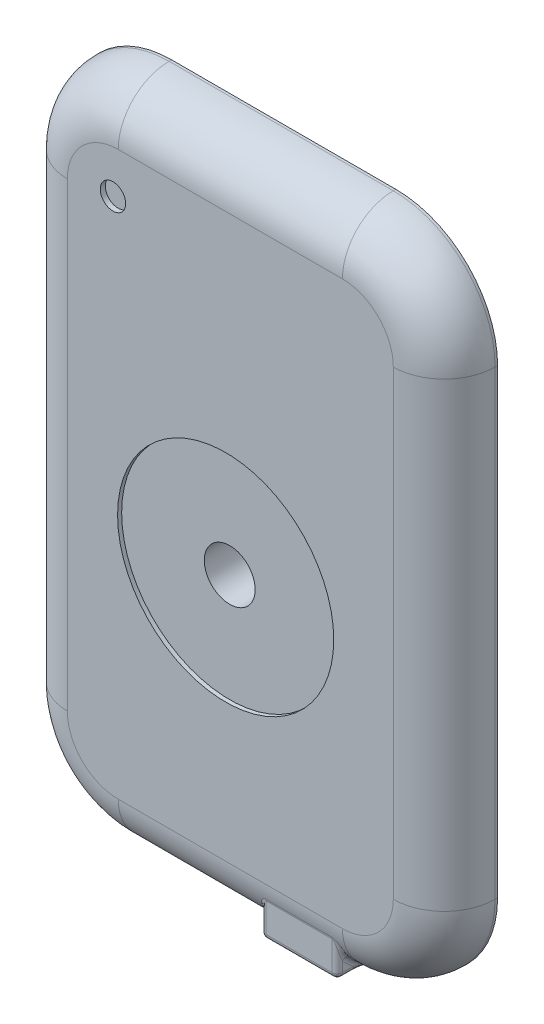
ISO-10303-21;
HEADER;
FILE_DESCRIPTION(('STEP AP214'),'2;1');
FILE_NAME('part.step','',(''),(''),'','','');
FILE_SCHEMA(('AUTOMOTIVE_DESIGN { 1 0 10303 214 1 1 1 1 }'));
ENDSEC;
DATA;
#1=APPLICATION_CONTEXT('core data for automotive mechanical design processes');
#2=APPLICATION_PROTOCOL_DEFINITION('international standard','automotive_design',2000,#1);
#3=PRODUCT_CONTEXT('',#1,'mechanical');
#4=PRODUCT('Part','Part','',(#3));
#5=PRODUCT_RELATED_PRODUCT_CATEGORY('part','',(#4));
#6=PRODUCT_DEFINITION_FORMATION('','',#4);
#7=PRODUCT_DEFINITION_CONTEXT('part definition',#1,'design');
#8=PRODUCT_DEFINITION('design','',#6,#7);
#9=PRODUCT_DEFINITION_SHAPE('','',#8);
#10=(LENGTH_UNIT() NAMED_UNIT(*) SI_UNIT(.MILLI.,.METRE.));
#11=(NAMED_UNIT(*) PLANE_ANGLE_UNIT() SI_UNIT($,.RADIAN.));
#12=(NAMED_UNIT(*) SI_UNIT($,.STERADIAN.) SOLID_ANGLE_UNIT());
#13=UNCERTAINTY_MEASURE_WITH_UNIT(LENGTH_MEASURE(1.E-05),#10,'distance_accuracy_value','');
#14=(GEOMETRIC_REPRESENTATION_CONTEXT(3) GLOBAL_UNCERTAINTY_ASSIGNED_CONTEXT((#13)) GLOBAL_UNIT_ASSIGNED_CONTEXT((#10,
#11,#12)) REPRESENTATION_CONTEXT('',''));
#15=CARTESIAN_POINT('',(0.,0.,0.));
#16=DIRECTION('',(0.,0.,1.));
#17=DIRECTION('',(1.,0.,0.));
#18=AXIS2_PLACEMENT_3D('',#15,#16,#17);
#19=CARTESIAN_POINT('',(-208.887445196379,-173.282653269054,26.67));
#20=DIRECTION('',(0.,0.,-1.));
#21=DIRECTION('',(-1.,0.,0.));
#22=AXIS2_PLACEMENT_3D('',#19,#20,#21);
#23=CYLINDRICAL_SURFACE('',#22,50.8);
#24=DIRECTION('',(0.,0.,-1.));
#25=VECTOR('',#24,1.);
#26=CARTESIAN_POINT('',(-259.687445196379,-173.282653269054,26.67));
#27=LINE('',#26,#25);
#28=CARTESIAN_POINT('',(-259.687445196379,-173.282653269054,1.27));
#29=VERTEX_POINT('',#28);
#30=CARTESIAN_POINT('',(-259.687445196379,-173.282653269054,0.));
#31=VERTEX_POINT('',#30);
#32=EDGE_CURVE('E183',#29,#31,#27,.T.);
#33=ORIENTED_EDGE('',*,*,#32,.F.);
#34=CARTESIAN_POINT('',(-208.887445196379,-173.282653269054,1.27));
#35=DIRECTION('',(0.,0.,1.));
#36=DIRECTION('',(1.,0.,0.));
#37=AXIS2_PLACEMENT_3D('',#34,#35,#36);
#38=CIRCLE('',#37,50.8);
#39=CARTESIAN_POINT('',(-208.887445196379,-122.482653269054,1.27));
#40=VERTEX_POINT('',#39);
#41=EDGE_CURVE('E271',#29,#40,#38,.F.);
#42=ORIENTED_EDGE('',*,*,#41,.T.);
#43=DIRECTION('',(0.,0.,-1.));
#44=VECTOR('',#43,1.);
#45=CARTESIAN_POINT('',(-208.887445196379,-122.482653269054,26.67));
#46=LINE('',#45,#44);
#47=CARTESIAN_POINT('',(-208.887445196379,-122.482653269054,0.));
#48=VERTEX_POINT('',#47);
#49=EDGE_CURVE('E207',#40,#48,#46,.T.);
#50=ORIENTED_EDGE('',*,*,#49,.T.);
#51=CARTESIAN_POINT('',(-208.887445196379,-173.282653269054,0.));
#52=DIRECTION('',(0.,0.,1.));
#53=DIRECTION('',(1.,0.,0.));
#54=AXIS2_PLACEMENT_3D('',#51,#52,#53);
#55=CIRCLE('',#54,50.8);
#56=EDGE_CURVE('E201',#48,#31,#55,.T.);
#57=ORIENTED_EDGE('',*,*,#56,.T.);
#58=EDGE_LOOP('',(#33,#42,#50,#57));
#59=FACE_BOUND('',#58,.T.);
#60=ADVANCED_FACE('F35',(#59),#23,.T.);
#61=CARTESIAN_POINT('',(-259.687445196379,-173.282653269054,26.67));
#62=DIRECTION('',(1.,0.,0.));
#63=DIRECTION('',(0.,1.,0.));
#64=AXIS2_PLACEMENT_3D('',#61,#62,#63);
#65=PLANE('',#64);
#66=DIRECTION('',(0.,0.,-1.));
#67=VECTOR('',#66,1.);
#68=CARTESIAN_POINT('',(-259.68744519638,-403.389302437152,26.67));
#69=LINE('',#68,#67);
#70=CARTESIAN_POINT('',(-259.68744519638,-403.389302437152,1.27));
#71=VERTEX_POINT('',#70);
#72=CARTESIAN_POINT('',(-259.68744519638,-403.389302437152,0.));
#73=VERTEX_POINT('',#72);
#74=EDGE_CURVE('E195',#71,#73,#69,.T.);
#75=ORIENTED_EDGE('',*,*,#74,.F.);
#76=DIRECTION('',(0.,-1.,0.));
#77=VECTOR('',#76,1.);
#78=CARTESIAN_POINT('',(-259.687445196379,-173.282653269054,1.27));
#79=LINE('',#78,#77);
#80=EDGE_CURVE('E190',#71,#29,#79,.F.);
#81=ORIENTED_EDGE('',*,*,#80,.T.);
#82=ORIENTED_EDGE('',*,*,#32,.T.);
#83=DIRECTION('',(0.,-1.,0.));
#84=VECTOR('',#83,1.);
#85=CARTESIAN_POINT('',(-259.687445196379,-173.282653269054,0.));
#86=LINE('',#85,#84);
#87=EDGE_CURVE('E187',#31,#73,#86,.T.);
#88=ORIENTED_EDGE('',*,*,#87,.T.);
#89=EDGE_LOOP('',(#75,#81,#82,#88));
#90=FACE_BOUND('',#89,.T.);
#91=ADVANCED_FACE('F186',(#90),#65,.F.);
#92=CARTESIAN_POINT('',(-208.88744519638,-403.389302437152,26.67));
#93=DIRECTION('',(0.,0.,-1.));
#94=DIRECTION('',(-1.,0.,0.));
#95=AXIS2_PLACEMENT_3D('',#92,#93,#94);
#96=CYLINDRICAL_SURFACE('',#95,50.8);
#97=DIRECTION('',(0.,0.,-1.));
#98=VECTOR('',#97,1.);
#99=CARTESIAN_POINT('',(-208.887445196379,-454.189302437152,26.67));
#100=LINE('',#99,#98);
#101=CARTESIAN_POINT('',(-208.887445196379,-454.189302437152,1.27));
#102=VERTEX_POINT('',#101);
#103=CARTESIAN_POINT('',(-208.887445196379,-454.189302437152,0.));
#104=VERTEX_POINT('',#103);
#105=EDGE_CURVE('E240',#102,#104,#100,.T.);
#106=ORIENTED_EDGE('',*,*,#105,.F.);
#107=CARTESIAN_POINT('',(-208.88744519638,-403.389302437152,1.27));
#108=DIRECTION('',(0.,0.,1.));
#109=DIRECTION('',(1.,0.,0.));
#110=AXIS2_PLACEMENT_3D('',#107,#108,#109);
#111=CIRCLE('',#110,50.8);
#112=EDGE_CURVE('E273',#102,#71,#111,.F.);
#113=ORIENTED_EDGE('',*,*,#112,.T.);
#114=ORIENTED_EDGE('',*,*,#74,.T.);
#115=CARTESIAN_POINT('',(-208.88744519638,-403.389302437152,0.));
#116=DIRECTION('',(0.,0.,1.));
#117=DIRECTION('',(1.,0.,0.));
#118=AXIS2_PLACEMENT_3D('',#115,#116,#117);
#119=CIRCLE('',#118,50.8);
#120=EDGE_CURVE('E204',#73,#104,#119,.T.);
#121=ORIENTED_EDGE('',*,*,#120,.T.);
#122=EDGE_LOOP('',(#106,#113,#114,#121));
#123=FACE_BOUND('',#122,.T.);
#124=ADVANCED_FACE('F502',(#123),#96,.T.);
#125=CARTESIAN_POINT('',(-208.887445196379,-454.189302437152,26.67));
#126=DIRECTION('',(0.,1.,0.));
#127=DIRECTION('',(0.,0.,1.));
#128=AXIS2_PLACEMENT_3D('',#125,#126,#127);
#129=PLANE('',#128);
#130=CARTESIAN_POINT('',(-119.731723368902,-454.189302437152,11.4843142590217));
#131=DIRECTION('',(0.,-1.,0.));
#132=DIRECTION('',(0.,0.,-1.));
#133=AXIS2_PLACEMENT_3D('',#130,#131,#132);
#134=CIRCLE('',#133,10.16);
#135=CARTESIAN_POINT('',(-119.731723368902,-454.189302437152,1.32431425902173));
#136=VERTEX_POINT('',#135);
#137=EDGE_CURVE('E766',#136,#136,#134,.T.);
#138=ORIENTED_EDGE('',*,*,#137,.F.);
#139=EDGE_LOOP('',(#138));
#140=FACE_BOUND('',#139,.T.);
#141=DIRECTION('',(0.,0.,-1.));
#142=VECTOR('',#141,1.);
#143=CARTESIAN_POINT('',(-96.9646572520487,-454.189302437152,26.67));
#144=LINE('',#143,#142);
#145=CARTESIAN_POINT('',(-96.9646572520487,-454.189302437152,1.27));
#146=VERTEX_POINT('',#145);
#147=CARTESIAN_POINT('',(-96.9646572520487,-454.189302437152,0.));
#148=VERTEX_POINT('',#147);
#149=EDGE_CURVE('E238',#146,#148,#144,.T.);
#150=ORIENTED_EDGE('',*,*,#149,.F.);
#151=DIRECTION('',(1.,0.,0.));
#152=VECTOR('',#151,1.);
#153=CARTESIAN_POINT('',(-208.887445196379,-454.189302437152,1.27));
#154=LINE('',#153,#152);
#155=CARTESIAN_POINT('',(-98.2858739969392,-454.189302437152,1.27));
#156=VERTEX_POINT('',#155);
#157=EDGE_CURVE('E269',#146,#156,#154,.F.);
#158=ORIENTED_EDGE('',*,*,#157,.T.);
#159=CARTESIAN_POINT('',(-102.608981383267,-454.189302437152,21.623320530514));
#160=CARTESIAN_POINT('',(-99.0524888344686,-454.189302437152,20.1638951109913));
#161=CARTESIAN_POINT('',(-100.447427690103,-450.653055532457,20.7363156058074));
#162=CARTESIAN_POINT('',(-102.716267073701,-454.189302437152,21.361643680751));
#163=CARTESIAN_POINT('',(-99.2055666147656,-454.189302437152,20.0660960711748));
#164=CARTESIAN_POINT('',(-100.501070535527,-450.712360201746,20.5388781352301));
#165=CARTESIAN_POINT('',(-102.810201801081,-454.189302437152,21.0948395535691));
#166=CARTESIAN_POINT('',(-99.3567434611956,-454.189302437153,19.9436547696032));
#167=CARTESIAN_POINT('',(-100.548037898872,-450.773224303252,20.3358233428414));
#168=CARTESIAN_POINT('',(-102.973677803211,-454.189302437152,20.5542763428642));
#169=CARTESIAN_POINT('',(-99.643360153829,-454.189302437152,19.6608994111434));
#170=CARTESIAN_POINT('',(-100.629775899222,-450.89723144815,19.9205656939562));
#171=CARTESIAN_POINT('',(-103.043257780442,-454.189302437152,20.2805290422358));
#172=CARTESIAN_POINT('',(-99.7794294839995,-454.189302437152,19.5018954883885));
#173=CARTESIAN_POINT('',(-100.664565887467,-450.960370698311,19.7083779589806));
#174=CARTESIAN_POINT('',(-103.160277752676,-454.189302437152,19.7303210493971));
#175=CARTESIAN_POINT('',(-100.031633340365,-454.189302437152,19.1553709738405));
#176=CARTESIAN_POINT('',(-100.723075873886,-451.087866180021,19.2777050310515));
#177=CARTESIAN_POINT('',(-103.207858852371,-454.189302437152,19.4538895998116));
#178=CARTESIAN_POINT('',(-100.14857302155,-454.189302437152,18.9688850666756));
#179=CARTESIAN_POINT('',(-100.7468664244,-451.152211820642,19.0592697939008));
#180=CARTESIAN_POINT('',(-103.283698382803,-454.189302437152,18.8983766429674));
#181=CARTESIAN_POINT('',(-100.362705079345,-454.189302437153,18.5735015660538));
#182=CARTESIAN_POINT('',(-100.784786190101,-451.281949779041,18.6158819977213));
#183=CARTESIAN_POINT('',(-103.311954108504,-454.189302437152,18.619294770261));
#184=CARTESIAN_POINT('',(-100.460582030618,-454.189302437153,18.3650903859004));
#185=CARTESIAN_POINT('',(-100.79891405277,-451.347342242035,18.3909285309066));
#186=CARTESIAN_POINT('',(-103.343213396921,-454.189302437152,18.1723619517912));
#187=CARTESIAN_POINT('',(-100.602124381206,-454.189302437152,18.0164563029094));
#188=CARTESIAN_POINT('',(-100.814543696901,-451.4522577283,18.0269575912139));
#189=CARTESIAN_POINT('',(-103.351801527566,-454.189302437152,18.004871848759));
#190=CARTESIAN_POINT('',(-100.651469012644,-454.189302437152,17.8837488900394));
#191=CARTESIAN_POINT('',(-100.818837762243,-451.491618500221,17.889726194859));
#192=CARTESIAN_POINT('',(-103.363129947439,-454.189302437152,17.6697163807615));
#193=CARTESIAN_POINT('',(-100.74341298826,-454.189302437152,17.6132200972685));
#194=CARTESIAN_POINT('',(-100.824501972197,-451.570420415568,17.6134159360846));
#195=CARTESIAN_POINT('',(-103.365870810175,-454.189302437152,17.5020510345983));
#196=CARTESIAN_POINT('',(-100.786137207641,-454.189302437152,17.4754333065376));
#197=CARTESIAN_POINT('',(-100.825872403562,-451.609861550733,17.4743372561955));
#198=CARTESIAN_POINT('',(-103.36588494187,-454.189302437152,16.7584723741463));
#199=CARTESIAN_POINT('',(-100.957773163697,-454.189302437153,16.8661377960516));
#200=CARTESIAN_POINT('',(-100.825879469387,-451.784762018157,16.8536552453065));
#201=CARTESIAN_POINT('',(-103.333602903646,-454.189302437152,16.182395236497));
#202=CARTESIAN_POINT('',(-101.057286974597,-454.189302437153,16.359694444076));
#203=CARTESIAN_POINT('',(-100.809738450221,-451.92021866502,16.3624645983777));
#204=CARTESIAN_POINT('',(-103.216943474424,-454.189302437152,15.0353296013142));
#205=CARTESIAN_POINT('',(-101.18644902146,-454.189302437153,15.3194382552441));
#206=CARTESIAN_POINT('',(-100.751408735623,-452.187526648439,15.3627910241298));
#207=CARTESIAN_POINT('',(-103.132496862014,-454.189302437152,14.464348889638));
#208=CARTESIAN_POINT('',(-101.219327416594,-454.189302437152,14.7845395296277));
#209=CARTESIAN_POINT('',(-100.709185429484,-452.319372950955,14.8542859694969));
#210=CARTESIAN_POINT('',(-102.920997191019,-454.189302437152,13.3275881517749));
#211=CARTESIAN_POINT('',(-101.227330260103,-454.189302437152,13.6995506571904));
#212=CARTESIAN_POINT('',(-100.603435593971,-452.57673597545,13.8199798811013));
#213=CARTESIAN_POINT('',(-102.793737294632,-454.189302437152,12.7618473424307));
#214=CARTESIAN_POINT('',(-101.204355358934,-454.189302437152,13.1475008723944));
#215=CARTESIAN_POINT('',(-100.539805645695,-452.702218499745,13.2941062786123));
#216=CARTESIAN_POINT('',(-102.505138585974,-454.189302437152,11.6395675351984));
#217=CARTESIAN_POINT('',(-101.111244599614,-454.189302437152,12.0393970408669));
#218=CARTESIAN_POINT('',(-100.395506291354,-452.94301903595,12.2293713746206));
#219=CARTESIAN_POINT('',(-102.343814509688,-454.189302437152,11.0830246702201));
#220=CARTESIAN_POINT('',(-101.04241792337,-454.189302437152,11.4811787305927));
#221=CARTESIAN_POINT('',(-100.314844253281,-453.058341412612,11.6905157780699));
#222=CARTESIAN_POINT('',(-101.916697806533,-454.189302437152,9.73437028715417));
#223=CARTESIAN_POINT('',(-100.829723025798,-454.189302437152,10.1263537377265));
#224=CARTESIAN_POINT('',(-100.101285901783,-453.324159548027,10.3599753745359));
#225=CARTESIAN_POINT('',(-101.636257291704,-454.189302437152,8.94693503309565));
#226=CARTESIAN_POINT('',(-100.665821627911,-454.189302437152,9.31607257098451));
#227=CARTESIAN_POINT('',(-99.9610656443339,-453.467654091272,9.5618733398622));
#228=CARTESIAN_POINT('',(-101.036243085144,-454.189302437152,7.38711180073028));
#229=CARTESIAN_POINT('',(-100.284339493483,-454.189302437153,7.70521685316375));
#230=CARTESIAN_POINT('',(-99.6610585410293,-453.720016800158,7.94553217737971));
#231=CARTESIAN_POINT('',(-100.716652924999,-454.189302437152,6.61473031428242));
#232=CARTESIAN_POINT('',(-100.066549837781,-454.189302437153,6.89737172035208));
#233=CARTESIAN_POINT('',(-99.5012634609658,-453.828870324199,7.12728469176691));
#234=CARTESIAN_POINT('',(-100.053290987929,-454.189302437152,5.08199938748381));
#235=CARTESIAN_POINT('',(-99.5987654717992,-454.189302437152,5.29402549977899));
#236=CARTESIAN_POINT('',(-99.169582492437,-454.005690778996,5.47789918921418));
#237=CARTESIAN_POINT('',(-99.7095577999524,-454.189302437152,4.32163302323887));
#238=CARTESIAN_POINT('',(-99.3473609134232,-454.189302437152,4.49128598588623));
#239=CARTESIAN_POINT('',(-98.9977158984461,-454.07372136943,4.64678332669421));
#240=CARTESIAN_POINT('',(-99.0101595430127,-454.189302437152,2.80661758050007));
#241=CARTESIAN_POINT('',(-98.8302423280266,-454.189302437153,2.89560246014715));
#242=CARTESIAN_POINT('',(-98.6480167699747,-454.165242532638,2.97725916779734));
#243=CARTESIAN_POINT('',(-98.6544961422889,-454.189302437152,2.05196772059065));
#244=CARTESIAN_POINT('',(-98.5623543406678,-454.189302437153,2.09545342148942));
#245=CARTESIAN_POINT('',(-98.470185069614,-454.188739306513,2.13885190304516));
#246=CARTESIAN_POINT('',(-98.2944699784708,-454.189302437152,1.28823483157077));
#247=CARTESIAN_POINT('',(-98.2923209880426,-454.189302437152,1.2892478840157));
#248=CARTESIAN_POINT('',(-98.290171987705,-454.1892991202,1.29026092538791));
#249=CARTESIAN_POINT('',(-98.2901719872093,-454.189302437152,1.27911741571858));
#250=CARTESIAN_POINT('',(-98.2890974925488,-454.189302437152,1.27962393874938));
#251=CARTESIAN_POINT('',(-98.2880229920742,-454.189302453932,1.28013046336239));
#252=CARTESIAN_POINT('',(-98.2858739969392,-454.189302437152,1.27));
#253=CARTESIAN_POINT('',(-98.2858739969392,-454.189302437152,1.27));
#254=CARTESIAN_POINT('',(-98.2858739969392,-454.189302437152,1.27));
#255=(BOUNDED_SURFACE() B_SPLINE_SURFACE(3,2,((#159,#160,#161),(#162,#163,#164),(#165,#166,
#167),(#168,#169,#170),(#171,#172,#173),(#174,#175,#176),(#177,#178,#179),(#180,#181,#182),
(#183,#184,#185),(#186,#187,#188),(#189,#190,#191),(#192,#193,#194),(#195,#196,#197),(#198,#199,
#200),(#201,#202,#203),(#204,#205,#206),(#207,#208,#209),(#210,#211,#212),(#213,#214,#215),
(#216,#217,#218),(#219,#220,#221),(#222,#223,#224),(#225,#226,#227),(#228,#229,#230),(#231,#232,
#233),(#234,#235,#236),(#237,#238,#239),(#240,#241,#242),(#243,#244,#245),(#246,#247,#248),
(#249,#250,#251),(#252,#253,#254)),.UNSPECIFIED.,.F.,.F.,.F.) B_SPLINE_SURFACE_WITH_KNOTS((4,2,
2,2,2,2,2,2,2,2,2,2,2,2,2,4),(3,3),(0.,0.84762554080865,1.69389792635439,2.53466417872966,
3.37554809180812,3.87858309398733,4.38156875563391,6.10907118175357,7.83887091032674,
9.57715054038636,11.3146797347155,13.8206652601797,16.3277085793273,18.8308321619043,
21.3336071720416,21.3638462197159),(0.,1.),
.UNSPECIFIED.) GEOMETRIC_REPRESENTATION_ITEM() RATIONAL_B_SPLINE_SURFACE(((1.,0.55126074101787,
1.),(1.,0.561853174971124,1.),(1.,0.572411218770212,1.),(1.,0.593348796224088,1.),(1.,
0.60372858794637,1.),(1.,0.624167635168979,1.),(1.,0.634228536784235,1.),(1.,0.654052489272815,
1.),(1.,0.663815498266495,1.),(1.,0.679149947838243,1.),(1.,0.684829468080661,1.),(1.,
0.696062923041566,1.),(1.,0.701616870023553,1.),(1.,0.725961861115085,1.),(1.,0.744061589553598,
1.),(1.,0.778620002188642,1.),(1.,0.795076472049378,1.),(1.,0.826323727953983,1.),(1.,
0.841105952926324,1.),(1.,0.868827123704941,1.),(1.,0.881766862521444,1.),(1.,0.911041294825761,
1.),(1.,0.926346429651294,1.),(1.,0.952783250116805,1.),(1.,0.963913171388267,1.),(1.,
0.981802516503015,1.),(1.,0.988568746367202,1.),(1.,0.997639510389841,1.),(1.,0.999944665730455,
1.),(1.,0.999999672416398,1.),(1.,1.00000000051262,1.),(1.,1.,1.))) REPRESENTATION_ITEM('') SURFACE());
#256=CARTESIAN_POINT('',(-102.608981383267,-454.189302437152,21.623320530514));
#257=CARTESIAN_POINT('',(-102.716267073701,-454.189302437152,21.361643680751));
#258=CARTESIAN_POINT('',(-102.810201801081,-454.189302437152,21.0948395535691));
#259=CARTESIAN_POINT('',(-102.973677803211,-454.189302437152,20.5542763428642));
#260=CARTESIAN_POINT('',(-103.043257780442,-454.189302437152,20.2805290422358));
#261=CARTESIAN_POINT('',(-103.160277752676,-454.189302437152,19.7303210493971));
#262=CARTESIAN_POINT('',(-103.207858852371,-454.189302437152,19.4538895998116));
#263=CARTESIAN_POINT('',(-103.283698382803,-454.189302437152,18.8983766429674));
#264=CARTESIAN_POINT('',(-103.311954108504,-454.189302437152,18.619294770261));
#265=CARTESIAN_POINT('',(-103.343213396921,-454.189302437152,18.1723619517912));
#266=CARTESIAN_POINT('',(-103.351801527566,-454.189302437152,18.004871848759));
#267=CARTESIAN_POINT('',(-103.363129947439,-454.189302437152,17.6697163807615));
#268=CARTESIAN_POINT('',(-103.365870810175,-454.189302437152,17.5020510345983));
#269=CARTESIAN_POINT('',(-103.36588494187,-454.189302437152,16.7584723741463));
#270=CARTESIAN_POINT('',(-103.333602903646,-454.189302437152,16.182395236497));
#271=CARTESIAN_POINT('',(-103.216943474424,-454.189302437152,15.0353296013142));
#272=CARTESIAN_POINT('',(-103.132496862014,-454.189302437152,14.464348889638));
#273=CARTESIAN_POINT('',(-102.920997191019,-454.189302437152,13.3275881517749));
#274=CARTESIAN_POINT('',(-102.793737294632,-454.189302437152,12.7618473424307));
#275=CARTESIAN_POINT('',(-102.505138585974,-454.189302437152,11.6395675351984));
#276=CARTESIAN_POINT('',(-102.343814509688,-454.189302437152,11.0830246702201));
#277=CARTESIAN_POINT('',(-101.916697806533,-454.189302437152,9.73437028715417));
#278=CARTESIAN_POINT('',(-101.636257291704,-454.189302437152,8.94693503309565));
#279=CARTESIAN_POINT('',(-101.036243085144,-454.189302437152,7.38711180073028));
#280=CARTESIAN_POINT('',(-100.716652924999,-454.189302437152,6.61473031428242));
#281=CARTESIAN_POINT('',(-100.053290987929,-454.189302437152,5.08199938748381));
#282=CARTESIAN_POINT('',(-99.7095577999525,-454.189302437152,4.32163302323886));
#283=CARTESIAN_POINT('',(-99.0101595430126,-454.189302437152,2.80661758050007));
#284=CARTESIAN_POINT('',(-98.6544961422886,-454.189302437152,2.05196772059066));
#285=CARTESIAN_POINT('',(-98.2944699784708,-454.189302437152,1.28823483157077));
#286=CARTESIAN_POINT('',(-98.2901719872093,-454.189302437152,1.27911741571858));
#287=CARTESIAN_POINT('',(-98.2858739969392,-454.189302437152,1.27));
#288=B_SPLINE_CURVE_WITH_KNOTS('',3,(#256,#257,#258,#259,#260,#261,#262,#263,#264,#265,#266,
#267,#268,#269,#270,#271,#272,#273,#274,#275,#276,#277,#278,#279,#280,#281,#282,#283,#284,#285,
#286,#287),.UNSPECIFIED.,.F.,.F.,(4,2,2,2,2,2,2,2,2,2,2,2,2,2,2,4),(0.,0.84762554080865,
1.69389792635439,2.53466417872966,3.37554809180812,3.87858309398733,4.38156875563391,
6.10907118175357,7.83887091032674,9.57715054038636,11.3146797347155,13.8206652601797,
16.3277085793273,18.8308321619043,21.3336071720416,21.3638462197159),.UNSPECIFIED.);
#289=CARTESIAN_POINT('',(-103.365873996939,-454.189302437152,17.3343705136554));
#290=VERTEX_POINT('',#289);
#291=EDGE_CURVE('E44',#156,#290,#288,.F.);
#292=ORIENTED_EDGE('',*,*,#291,.T.);
#293=DIRECTION('',(0.,0.,1.));
#294=VECTOR('',#293,1.);
#295=CARTESIAN_POINT('',(-103.365873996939,-454.189302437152,25.4));
#296=LINE('',#295,#294);
#297=CARTESIAN_POINT('',(-103.365873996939,-454.189302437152,22.86));
#298=VERTEX_POINT('',#297);
#299=EDGE_CURVE('E55',#290,#298,#296,.T.);
#300=ORIENTED_EDGE('',*,*,#299,.T.);
#301=DIRECTION('',(-1.,0.,0.));
#302=VECTOR('',#301,1.);
#303=CARTESIAN_POINT('',(-138.925873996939,-454.189302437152,22.86));
#304=LINE('',#303,#302);
#305=CARTESIAN_POINT('',(-136.385873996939,-454.189302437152,22.86));
#306=VERTEX_POINT('',#305);
#307=EDGE_CURVE('E331',#298,#306,#304,.T.);
#308=ORIENTED_EDGE('',*,*,#307,.T.);
#309=DIRECTION('',(0.,0.,-1.));
#310=VECTOR('',#309,1.);
#311=CARTESIAN_POINT('',(-136.385873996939,-454.189302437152,1.27));
#312=LINE('',#311,#310);
#313=CARTESIAN_POINT('',(-136.385873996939,-454.189302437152,17.3343705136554));
#314=VERTEX_POINT('',#313);
#315=EDGE_CURVE('E329',#306,#314,#312,.T.);
#316=ORIENTED_EDGE('',*,*,#315,.T.);
#317=CARTESIAN_POINT('',(-139.304320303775,-450.653055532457,20.7363156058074));
#318=CARTESIAN_POINT('',(-140.69925915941,-454.189302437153,20.1638951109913));
#319=CARTESIAN_POINT('',(-137.142766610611,-454.189302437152,21.623320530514));
#320=CARTESIAN_POINT('',(-139.250677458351,-450.712360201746,20.5388781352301));
#321=CARTESIAN_POINT('',(-140.546181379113,-454.189302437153,20.0660960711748));
#322=CARTESIAN_POINT('',(-137.035480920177,-454.189302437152,21.361643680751));
#323=CARTESIAN_POINT('',(-139.203710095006,-450.773224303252,20.3358233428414));
#324=CARTESIAN_POINT('',(-140.395004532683,-454.189302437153,19.9436547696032));
#325=CARTESIAN_POINT('',(-136.941546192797,-454.189302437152,21.0948395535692));
#326=CARTESIAN_POINT('',(-139.121972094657,-450.89723144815,19.9205656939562));
#327=CARTESIAN_POINT('',(-140.108387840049,-454.189302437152,19.6608994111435));
#328=CARTESIAN_POINT('',(-136.778070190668,-454.189302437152,20.5542763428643));
#329=CARTESIAN_POINT('',(-139.087182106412,-450.960370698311,19.7083779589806));
#330=CARTESIAN_POINT('',(-139.972318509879,-454.189302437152,19.5018954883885));
#331=CARTESIAN_POINT('',(-136.708490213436,-454.189302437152,20.2805290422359));
#332=CARTESIAN_POINT('',(-139.028672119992,-451.087866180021,19.2777050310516));
#333=CARTESIAN_POINT('',(-139.720114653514,-454.189302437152,19.1553709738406));
#334=CARTESIAN_POINT('',(-136.591470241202,-454.189302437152,19.7303210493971));
#335=CARTESIAN_POINT('',(-139.004881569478,-451.152211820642,19.0592697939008));
#336=CARTESIAN_POINT('',(-139.603174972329,-454.189302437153,18.9688850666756));
#337=CARTESIAN_POINT('',(-136.543889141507,-454.189302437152,19.4538895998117));
#338=CARTESIAN_POINT('',(-138.966961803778,-451.281949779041,18.6158819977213));
#339=CARTESIAN_POINT('',(-139.389042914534,-454.189302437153,18.5735015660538));
#340=CARTESIAN_POINT('',(-136.468049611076,-454.189302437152,18.8983766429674));
#341=CARTESIAN_POINT('',(-138.952833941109,-451.347342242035,18.3909285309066));
#342=CARTESIAN_POINT('',(-139.29116596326,-454.189302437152,18.3650903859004));
#343=CARTESIAN_POINT('',(-136.439793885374,-454.189302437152,18.619294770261));
#344=CARTESIAN_POINT('',(-138.937204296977,-451.4522577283,18.0269575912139));
#345=CARTESIAN_POINT('',(-139.149623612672,-454.189302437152,18.0164563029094));
#346=CARTESIAN_POINT('',(-136.408534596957,-454.189302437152,18.1723619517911));
#347=CARTESIAN_POINT('',(-138.932910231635,-451.491618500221,17.8897261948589));
#348=CARTESIAN_POINT('',(-139.100278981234,-454.189302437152,17.8837488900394));
#349=CARTESIAN_POINT('',(-136.399946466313,-454.189302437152,18.004871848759));
#350=CARTESIAN_POINT('',(-138.927246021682,-451.570420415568,17.6134159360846));
#351=CARTESIAN_POINT('',(-139.008335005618,-454.189302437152,17.6132200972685));
#352=CARTESIAN_POINT('',(-136.388618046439,-454.189302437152,17.6697163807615));
#353=CARTESIAN_POINT('',(-138.925875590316,-451.609861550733,17.4743372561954));
#354=CARTESIAN_POINT('',(-138.965610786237,-454.189302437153,17.4754333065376));
#355=CARTESIAN_POINT('',(-136.385877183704,-454.189302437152,17.5020510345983));
#356=CARTESIAN_POINT('',(-138.925868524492,-451.784762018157,16.8536552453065));
#357=CARTESIAN_POINT('',(-138.793974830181,-454.189302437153,16.8661377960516));
#358=CARTESIAN_POINT('',(-136.385863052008,-454.189302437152,16.7584723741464));
#359=CARTESIAN_POINT('',(-138.942009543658,-451.92021866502,16.3624645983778));
#360=CARTESIAN_POINT('',(-138.694461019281,-454.189302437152,16.359694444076));
#361=CARTESIAN_POINT('',(-136.418145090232,-454.189302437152,16.1823952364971));
#362=CARTESIAN_POINT('',(-139.000339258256,-452.187526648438,15.36279102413));
#363=CARTESIAN_POINT('',(-138.565298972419,-454.189302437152,15.3194382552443));
#364=CARTESIAN_POINT('',(-136.534804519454,-454.189302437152,15.0353296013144));
#365=CARTESIAN_POINT('',(-139.042562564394,-452.319372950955,14.8542859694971));
#366=CARTESIAN_POINT('',(-138.532420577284,-454.189302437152,14.7845395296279));
#367=CARTESIAN_POINT('',(-136.619251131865,-454.189302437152,14.4643488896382));
#368=CARTESIAN_POINT('',(-139.148312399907,-452.57673597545,13.8199798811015));
#369=CARTESIAN_POINT('',(-138.524417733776,-454.189302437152,13.6995506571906));
#370=CARTESIAN_POINT('',(-136.830750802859,-454.189302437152,13.3275881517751));
#371=CARTESIAN_POINT('',(-139.211942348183,-452.702218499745,13.2941062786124));
#372=CARTESIAN_POINT('',(-138.547392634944,-454.189302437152,13.1475008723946));
#373=CARTESIAN_POINT('',(-136.958010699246,-454.189302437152,12.7618473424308));
#374=CARTESIAN_POINT('',(-139.356241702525,-452.94301903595,12.2293713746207));
#375=CARTESIAN_POINT('',(-138.640503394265,-454.189302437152,12.039397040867));
#376=CARTESIAN_POINT('',(-137.246609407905,-454.189302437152,11.6395675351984));
#377=CARTESIAN_POINT('',(-139.436903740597,-453.058341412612,11.69051577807));
#378=CARTESIAN_POINT('',(-138.709330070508,-454.189302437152,11.4811787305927));
#379=CARTESIAN_POINT('',(-137.407933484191,-454.189302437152,11.0830246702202));
#380=CARTESIAN_POINT('',(-139.650462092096,-453.324159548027,10.3599753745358));
#381=CARTESIAN_POINT('',(-138.92202496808,-454.189302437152,10.1263537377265));
#382=CARTESIAN_POINT('',(-137.835050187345,-454.189302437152,9.73437028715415));
#383=CARTESIAN_POINT('',(-139.790682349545,-453.467654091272,9.56187333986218));
#384=CARTESIAN_POINT('',(-139.085926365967,-454.189302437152,9.31607257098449));
#385=CARTESIAN_POINT('',(-138.115490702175,-454.189302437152,8.94693503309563));
#386=CARTESIAN_POINT('',(-140.090689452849,-453.720016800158,7.94553217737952));
#387=CARTESIAN_POINT('',(-139.467408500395,-454.189302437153,7.70521685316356));
#388=CARTESIAN_POINT('',(-138.715504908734,-454.189302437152,7.3871118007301));
#389=CARTESIAN_POINT('',(-140.250484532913,-453.828870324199,7.12728469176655));
#390=CARTESIAN_POINT('',(-139.685198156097,-454.189302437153,6.89737172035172));
#391=CARTESIAN_POINT('',(-139.035095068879,-454.189302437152,6.61473031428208));
#392=CARTESIAN_POINT('',(-140.582165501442,-454.005690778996,5.47789918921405));
#393=CARTESIAN_POINT('',(-140.152982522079,-454.189302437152,5.29402549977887));
#394=CARTESIAN_POINT('',(-139.69845700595,-454.189302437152,5.08199938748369));
#395=CARTESIAN_POINT('',(-140.754032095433,-454.07372136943,4.64678332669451));
#396=CARTESIAN_POINT('',(-140.404387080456,-454.189302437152,4.49128598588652));
#397=CARTESIAN_POINT('',(-140.042190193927,-454.189302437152,4.32163302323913));
#398=CARTESIAN_POINT('',(-141.103731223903,-454.165242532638,2.97725916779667));
#399=CARTESIAN_POINT('',(-140.921505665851,-454.189302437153,2.89560246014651));
#400=CARTESIAN_POINT('',(-140.741588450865,-454.189302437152,2.80661758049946));
#401=CARTESIAN_POINT('',(-141.281562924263,-454.188739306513,2.1388519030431));
#402=CARTESIAN_POINT('',(-141.189393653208,-454.189302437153,2.09545342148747));
#403=CARTESIAN_POINT('',(-141.097251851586,-454.189302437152,2.05196772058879));
#404=CARTESIAN_POINT('',(-141.461576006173,-454.1892991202,1.29026092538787));
#405=CARTESIAN_POINT('',(-141.459427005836,-454.189302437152,1.28924788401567));
#406=CARTESIAN_POINT('',(-141.457278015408,-454.189302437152,1.28823483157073));
#407=CARTESIAN_POINT('',(-141.463725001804,-454.189302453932,1.28013046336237));
#408=CARTESIAN_POINT('',(-141.46265050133,-454.189302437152,1.27962393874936));
#409=CARTESIAN_POINT('',(-141.461576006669,-454.189302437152,1.27911741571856));
#410=CARTESIAN_POINT('',(-141.465873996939,-454.189302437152,1.27));
#411=CARTESIAN_POINT('',(-141.465873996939,-454.189302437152,1.27));
#412=CARTESIAN_POINT('',(-141.465873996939,-454.189302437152,1.27));
#413=(BOUNDED_SURFACE() B_SPLINE_SURFACE(3,2,((#317,#318,#319),(#320,#321,#322),(#323,#324,
#325),(#326,#327,#328),(#329,#330,#331),(#332,#333,#334),(#335,#336,#337),(#338,#339,#340),
(#341,#342,#343),(#344,#345,#346),(#347,#348,#349),(#350,#351,#352),(#353,#354,#355),(#356,#357,
#358),(#359,#360,#361),(#362,#363,#364),(#365,#366,#367),(#368,#369,#370),(#371,#372,#373),
(#374,#375,#376),(#377,#378,#379),(#380,#381,#382),(#383,#384,#385),(#386,#387,#388),(#389,#390,
#391),(#392,#393,#394),(#395,#396,#397),(#398,#399,#400),(#401,#402,#403),(#404,#405,#406),
(#407,#408,#409),(#410,#411,#412)),.UNSPECIFIED.,.F.,.F.,.F.) B_SPLINE_SURFACE_WITH_KNOTS((4,2,
2,2,2,2,2,2,2,2,2,2,2,2,2,4),(3,3),(0.,0.847625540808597,1.6938979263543,2.53466417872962,
3.37554809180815,3.87858309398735,4.38156875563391,6.10907118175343,7.83887091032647,
9.57715054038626,11.3146797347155,13.8206652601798,16.3277085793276,18.8308321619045,
21.3336071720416,21.3638462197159),(0.,1.),
.UNSPECIFIED.) GEOMETRIC_REPRESENTATION_ITEM() RATIONAL_B_SPLINE_SURFACE(((1.,0.551260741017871,
1.),(1.,0.561853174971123,1.),(1.,0.57241121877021,1.),(1.,0.593348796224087,1.),(1.,
0.603728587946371,1.),(1.,0.624167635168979,1.),(1.,0.634228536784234,1.),(1.,0.654052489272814,
1.),(1.,0.663815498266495,1.),(1.,0.679149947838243,1.),(1.,0.684829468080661,1.),(1.,
0.696062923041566,1.),(1.,0.701616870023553,1.),(1.,0.725961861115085,1.),(1.,0.744061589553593,
1.),(1.,0.778620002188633,1.),(1.,0.795076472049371,1.),(1.,0.82632372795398,1.),(1.,
0.841105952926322,1.),(1.,0.868827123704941,1.),(1.,0.881766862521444,1.),(1.,0.911041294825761,
1.),(1.,0.926346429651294,1.),(1.,0.952783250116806,1.),(1.,0.96391317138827,1.),(1.,
0.981802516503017,1.),(1.,0.988568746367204,1.),(1.,0.997639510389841,1.),(1.,0.999944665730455,
1.),(1.,0.999999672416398,1.),(1.,1.00000000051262,1.),(1.,1.,1.))) REPRESENTATION_ITEM('') SURFACE());
#414=CARTESIAN_POINT('',(-137.142766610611,-454.189302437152,21.623320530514));
#415=CARTESIAN_POINT('',(-137.035480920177,-454.189302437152,21.361643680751));
#416=CARTESIAN_POINT('',(-136.941546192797,-454.189302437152,21.0948395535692));
#417=CARTESIAN_POINT('',(-136.778070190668,-454.189302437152,20.5542763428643));
#418=CARTESIAN_POINT('',(-136.708490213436,-454.189302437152,20.2805290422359));
#419=CARTESIAN_POINT('',(-136.591470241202,-454.189302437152,19.7303210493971));
#420=CARTESIAN_POINT('',(-136.543889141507,-454.189302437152,19.4538895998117));
#421=CARTESIAN_POINT('',(-136.468049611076,-454.189302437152,18.8983766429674));
#422=CARTESIAN_POINT('',(-136.439793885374,-454.189302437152,18.619294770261));
#423=CARTESIAN_POINT('',(-136.408534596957,-454.189302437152,18.1723619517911));
#424=CARTESIAN_POINT('',(-136.399946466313,-454.189302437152,18.004871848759));
#425=CARTESIAN_POINT('',(-136.388618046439,-454.189302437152,17.6697163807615));
#426=CARTESIAN_POINT('',(-136.385877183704,-454.189302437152,17.5020510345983));
#427=CARTESIAN_POINT('',(-136.385863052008,-454.189302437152,16.7584723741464));
#428=CARTESIAN_POINT('',(-136.418145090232,-454.189302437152,16.1823952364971));
#429=CARTESIAN_POINT('',(-136.534804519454,-454.189302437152,15.0353296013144));
#430=CARTESIAN_POINT('',(-136.619251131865,-454.189302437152,14.4643488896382));
#431=CARTESIAN_POINT('',(-136.830750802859,-454.189302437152,13.3275881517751));
#432=CARTESIAN_POINT('',(-136.958010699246,-454.189302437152,12.7618473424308));
#433=CARTESIAN_POINT('',(-137.246609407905,-454.189302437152,11.6395675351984));
#434=CARTESIAN_POINT('',(-137.407933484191,-454.189302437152,11.0830246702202));
#435=CARTESIAN_POINT('',(-137.835050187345,-454.189302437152,9.73437028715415));
#436=CARTESIAN_POINT('',(-138.115490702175,-454.189302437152,8.94693503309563));
#437=CARTESIAN_POINT('',(-138.715504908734,-454.189302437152,7.3871118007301));
#438=CARTESIAN_POINT('',(-139.035095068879,-454.189302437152,6.61473031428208));
#439=CARTESIAN_POINT('',(-139.69845700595,-454.189302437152,5.08199938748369));
#440=CARTESIAN_POINT('',(-140.042190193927,-454.189302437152,4.32163302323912));
#441=CARTESIAN_POINT('',(-140.741588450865,-454.189302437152,2.80661758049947));
#442=CARTESIAN_POINT('',(-141.097251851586,-454.189302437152,2.05196772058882));
#443=CARTESIAN_POINT('',(-141.457278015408,-454.189302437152,1.28823483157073));
#444=CARTESIAN_POINT('',(-141.461576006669,-454.189302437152,1.27911741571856));
#445=CARTESIAN_POINT('',(-141.465873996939,-454.189302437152,1.27));
#446=B_SPLINE_CURVE_WITH_KNOTS('',3,(#414,#415,#416,#417,#418,#419,#420,#421,#422,#423,#424,
#425,#426,#427,#428,#429,#430,#431,#432,#433,#434,#435,#436,#437,#438,#439,#440,#441,#442,#443,
#444,#445),.UNSPECIFIED.,.F.,.F.,(4,2,2,2,2,2,2,2,2,2,2,2,2,2,2,4),(0.,0.847625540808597,
1.6938979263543,2.53466417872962,3.37554809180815,3.87858309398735,4.38156875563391,
6.10907118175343,7.83887091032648,9.57715054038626,11.3146797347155,13.8206652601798,
16.3277085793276,18.8308321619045,21.3336071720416,21.3638462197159),.UNSPECIFIED.);
#447=CARTESIAN_POINT('',(-141.465873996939,-454.189302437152,1.27));
#448=VERTEX_POINT('',#447);
#449=EDGE_CURVE('E11',#314,#448,#446,.T.);
#450=ORIENTED_EDGE('',*,*,#449,.T.);
#451=EDGE_CURVE('E268',#448,#102,#154,.F.);
#452=ORIENTED_EDGE('',*,*,#451,.T.);
#453=ORIENTED_EDGE('',*,*,#105,.T.);
#454=DIRECTION('',(1.,0.,0.));
#455=VECTOR('',#454,1.);
#456=CARTESIAN_POINT('',(-208.887445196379,-454.189302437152,0.));
#457=LINE('',#456,#455);
#458=EDGE_CURVE('E217',#104,#148,#457,.T.);
#459=ORIENTED_EDGE('',*,*,#458,.T.);
#460=EDGE_LOOP('',(#150,#158,#292,#300,#308,#316,#450,#452,#453,#459));
#461=FACE_BOUND('',#460,.T.);
#462=ADVANCED_FACE('F441',(#140,#461),#129,.F.);
#463=CARTESIAN_POINT('',(-96.9646572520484,-403.389302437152,26.67));
#464=DIRECTION('',(0.,0.,-1.));
#465=DIRECTION('',(-1.,0.,0.));
#466=AXIS2_PLACEMENT_3D('',#463,#464,#465);
#467=CYLINDRICAL_SURFACE('',#466,50.8);
#468=DIRECTION('',(0.,0.,-1.));
#469=VECTOR('',#468,1.);
#470=CARTESIAN_POINT('',(-46.1646572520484,-403.389302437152,26.67));
#471=LINE('',#470,#469);
#472=CARTESIAN_POINT('',(-46.1646572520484,-403.389302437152,1.27));
#473=VERTEX_POINT('',#472);
#474=CARTESIAN_POINT('',(-46.1646572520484,-403.389302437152,0.));
#475=VERTEX_POINT('',#474);
#476=EDGE_CURVE('E236',#473,#475,#471,.T.);
#477=ORIENTED_EDGE('',*,*,#476,.F.);
#478=CARTESIAN_POINT('',(-96.9646572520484,-403.389302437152,1.27));
#479=DIRECTION('',(0.,0.,1.));
#480=DIRECTION('',(1.,0.,0.));
#481=AXIS2_PLACEMENT_3D('',#478,#479,#480);
#482=CIRCLE('',#481,50.8);
#483=EDGE_CURVE('E266',#473,#146,#482,.F.);
#484=ORIENTED_EDGE('',*,*,#483,.T.);
#485=ORIENTED_EDGE('',*,*,#149,.T.);
#486=CARTESIAN_POINT('',(-96.9646572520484,-403.389302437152,0.));
#487=DIRECTION('',(0.,0.,1.));
#488=DIRECTION('',(1.,0.,0.));
#489=AXIS2_PLACEMENT_3D('',#486,#487,#488);
#490=CIRCLE('',#489,50.8);
#491=EDGE_CURVE('E220',#148,#475,#490,.T.);
#492=ORIENTED_EDGE('',*,*,#491,.T.);
#493=EDGE_LOOP('',(#477,#484,#485,#492));
#494=FACE_BOUND('',#493,.T.);
#495=ADVANCED_FACE('F644',(#494),#467,.T.);
#496=CARTESIAN_POINT('',(-46.1646572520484,-173.282653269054,26.67));
#497=DIRECTION('',(-1.,0.,0.));
#498=DIRECTION('',(0.,-1.,0.));
#499=AXIS2_PLACEMENT_3D('',#496,#497,#498);
#500=PLANE('',#499);
#501=DIRECTION('',(0.,0.,-1.));
#502=VECTOR('',#501,1.);
#503=CARTESIAN_POINT('',(-46.1646572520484,-173.282653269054,26.67));
#504=LINE('',#503,#502);
#505=CARTESIAN_POINT('',(-46.1646572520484,-173.282653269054,1.27));
#506=VERTEX_POINT('',#505);
#507=CARTESIAN_POINT('',(-46.1646572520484,-173.282653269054,0.));
#508=VERTEX_POINT('',#507);
#509=EDGE_CURVE('E234',#506,#508,#504,.T.);
#510=ORIENTED_EDGE('',*,*,#509,.F.);
#511=DIRECTION('',(0.,1.,0.));
#512=VECTOR('',#511,1.);
#513=CARTESIAN_POINT('',(-46.1646572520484,-403.389302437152,1.27));
#514=LINE('',#513,#512);
#515=EDGE_CURVE('E264',#506,#473,#514,.F.);
#516=ORIENTED_EDGE('',*,*,#515,.T.);
#517=ORIENTED_EDGE('',*,*,#476,.T.);
#518=DIRECTION('',(0.,1.,0.));
#519=VECTOR('',#518,1.);
#520=CARTESIAN_POINT('',(-46.1646572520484,-173.282653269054,0.));
#521=LINE('',#520,#519);
#522=EDGE_CURVE('E223',#475,#508,#521,.T.);
#523=ORIENTED_EDGE('',*,*,#522,.T.);
#524=EDGE_LOOP('',(#510,#516,#517,#523));
#525=FACE_BOUND('',#524,.T.);
#526=ADVANCED_FACE('F641',(#525),#500,.F.);
#527=CARTESIAN_POINT('',(-96.9646572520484,-173.282653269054,26.67));
#528=DIRECTION('',(0.,0.,-1.));
#529=DIRECTION('',(-1.,0.,0.));
#530=AXIS2_PLACEMENT_3D('',#527,#528,#529);
#531=CYLINDRICAL_SURFACE('',#530,50.8);
#532=DIRECTION('',(0.,0.,-1.));
#533=VECTOR('',#532,1.);
#534=CARTESIAN_POINT('',(-96.9646572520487,-122.482653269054,26.67));
#535=LINE('',#534,#533);
#536=CARTESIAN_POINT('',(-96.9646572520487,-122.482653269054,1.27));
#537=VERTEX_POINT('',#536);
#538=CARTESIAN_POINT('',(-96.9646572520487,-122.482653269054,0.));
#539=VERTEX_POINT('',#538);
#540=EDGE_CURVE('E232',#537,#539,#535,.T.);
#541=ORIENTED_EDGE('',*,*,#540,.F.);
#542=CARTESIAN_POINT('',(-96.9646572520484,-173.282653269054,1.27));
#543=DIRECTION('',(0.,0.,1.));
#544=DIRECTION('',(1.,0.,0.));
#545=AXIS2_PLACEMENT_3D('',#542,#543,#544);
#546=CIRCLE('',#545,50.8);
#547=EDGE_CURVE('E262',#537,#506,#546,.F.);
#548=ORIENTED_EDGE('',*,*,#547,.T.);
#549=ORIENTED_EDGE('',*,*,#509,.T.);
#550=CARTESIAN_POINT('',(-96.9646572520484,-173.282653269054,0.));
#551=DIRECTION('',(0.,0.,1.));
#552=DIRECTION('',(-1.,0.,0.));
#553=AXIS2_PLACEMENT_3D('',#550,#551,#552);
#554=CIRCLE('',#553,50.8);
#555=EDGE_CURVE('E226',#508,#539,#554,.T.);
#556=ORIENTED_EDGE('',*,*,#555,.T.);
#557=EDGE_LOOP('',(#541,#548,#549,#556));
#558=FACE_BOUND('',#557,.T.);
#559=ADVANCED_FACE('F637',(#558),#531,.T.);
#560=CARTESIAN_POINT('',(-208.887445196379,-122.482653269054,26.67));
#561=DIRECTION('',(0.,-1.,0.));
#562=DIRECTION('',(0.,0.,-1.));
#563=AXIS2_PLACEMENT_3D('',#560,#561,#562);
#564=PLANE('',#563);
#565=ORIENTED_EDGE('',*,*,#49,.F.);
#566=DIRECTION('',(-1.,0.,0.));
#567=VECTOR('',#566,1.);
#568=CARTESIAN_POINT('',(-96.9646572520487,-122.482653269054,1.27));
#569=LINE('',#568,#567);
#570=EDGE_CURVE('E259',#40,#537,#569,.F.);
#571=ORIENTED_EDGE('',*,*,#570,.T.);
#572=ORIENTED_EDGE('',*,*,#540,.T.);
#573=DIRECTION('',(-1.,0.,0.));
#574=VECTOR('',#573,1.);
#575=CARTESIAN_POINT('',(-208.887445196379,-122.482653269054,0.));
#576=LINE('',#575,#574);
#577=EDGE_CURVE('E229',#539,#48,#576,.T.);
#578=ORIENTED_EDGE('',*,*,#577,.T.);
#579=EDGE_LOOP('',(#565,#571,#572,#578));
#580=FACE_BOUND('',#579,.T.);
#581=ADVANCED_FACE('F631',(#580),#564,.F.);
#582=CARTESIAN_POINT('',(-208.887445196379,-173.282653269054,26.67));
#583=DIRECTION('',(0.,0.,1.));
#584=DIRECTION('',(1.,0.,0.));
#585=AXIS2_PLACEMENT_3D('',#582,#583,#584);
#586=PLANE('',#585);
#587=CARTESIAN_POINT('',(-211.517662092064,-169.49854023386,26.67));
#588=DIRECTION('',(0.,0.,1.));
#589=DIRECTION('',(1.,0.,0.));
#590=AXIS2_PLACEMENT_3D('',#587,#588,#589);
#591=CIRCLE('',#590,6.34999999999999);
#592=CARTESIAN_POINT('',(-205.167662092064,-169.49854023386,26.67));
#593=VERTEX_POINT('',#592);
#594=EDGE_CURVE('E757',#593,#593,#591,.T.);
#595=ORIENTED_EDGE('',*,*,#594,.F.);
#596=EDGE_LOOP('',(#595));
#597=FACE_BOUND('',#596,.T.);
#598=CARTESIAN_POINT('',(-96.9646572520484,-173.282653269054,26.67));
#599=DIRECTION('',(0.,0.,1.));
#600=DIRECTION('',(1.,0.,0.));
#601=AXIS2_PLACEMENT_3D('',#598,#599,#600);
#602=CIRCLE('',#601,25.4);
#603=CARTESIAN_POINT('',(-71.5646572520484,-173.282653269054,26.67));
#604=VERTEX_POINT('',#603);
#605=CARTESIAN_POINT('',(-96.9646572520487,-147.882653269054,26.67));
#606=VERTEX_POINT('',#605);
#607=EDGE_CURVE('E254',#604,#606,#602,.T.);
#608=ORIENTED_EDGE('',*,*,#607,.T.);
#609=DIRECTION('',(-1.,0.,0.));
#610=VECTOR('',#609,1.);
#611=CARTESIAN_POINT('',(-208.887445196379,-147.882653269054,26.67));
#612=LINE('',#611,#610);
#613=CARTESIAN_POINT('',(-208.887445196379,-147.882653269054,26.67));
#614=VERTEX_POINT('',#613);
#615=EDGE_CURVE('E256',#606,#614,#612,.T.);
#616=ORIENTED_EDGE('',*,*,#615,.T.);
#617=CARTESIAN_POINT('',(-208.887445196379,-173.282653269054,26.67));
#618=DIRECTION('',(0.,0.,1.));
#619=DIRECTION('',(1.,0.,0.));
#620=AXIS2_PLACEMENT_3D('',#617,#618,#619);
#621=CIRCLE('',#620,25.4);
#622=CARTESIAN_POINT('',(-234.287445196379,-173.282653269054,26.67));
#623=VERTEX_POINT('',#622);
#624=EDGE_CURVE('E246',#614,#623,#621,.T.);
#625=ORIENTED_EDGE('',*,*,#624,.T.);
#626=DIRECTION('',(0.,-1.,0.));
#627=VECTOR('',#626,1.);
#628=CARTESIAN_POINT('',(-234.28744519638,-403.389302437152,26.67));
#629=LINE('',#628,#627);
#630=CARTESIAN_POINT('',(-234.28744519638,-403.389302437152,26.67));
#631=VERTEX_POINT('',#630);
#632=EDGE_CURVE('E194',#623,#631,#629,.T.);
#633=ORIENTED_EDGE('',*,*,#632,.T.);
#634=CARTESIAN_POINT('',(-208.88744519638,-403.389302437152,26.67));
#635=DIRECTION('',(0.,0.,1.));
#636=DIRECTION('',(1.,0.,0.));
#637=AXIS2_PLACEMENT_3D('',#634,#635,#636);
#638=CIRCLE('',#637,25.4);
#639=CARTESIAN_POINT('',(-208.887445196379,-428.789302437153,26.67));
#640=VERTEX_POINT('',#639);
#641=EDGE_CURVE('E244',#631,#640,#638,.T.);
#642=ORIENTED_EDGE('',*,*,#641,.T.);
#643=DIRECTION('',(1.,0.,0.));
#644=VECTOR('',#643,1.);
#645=CARTESIAN_POINT('',(-96.9646572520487,-428.789302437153,26.67));
#646=LINE('',#645,#644);
#647=CARTESIAN_POINT('',(-96.9646572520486,-428.789302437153,26.67));
#648=VERTEX_POINT('',#647);
#649=EDGE_CURVE('E248',#640,#648,#646,.T.);
#650=ORIENTED_EDGE('',*,*,#649,.T.);
#651=CARTESIAN_POINT('',(-96.9646572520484,-403.389302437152,26.67));
#652=DIRECTION('',(0.,0.,1.));
#653=DIRECTION('',(1.,0.,0.));
#654=AXIS2_PLACEMENT_3D('',#651,#652,#653);
#655=CIRCLE('',#654,25.4);
#656=CARTESIAN_POINT('',(-71.5646572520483,-403.389302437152,26.67));
#657=VERTEX_POINT('',#656);
#658=EDGE_CURVE('E250',#648,#657,#655,.T.);
#659=ORIENTED_EDGE('',*,*,#658,.T.);
#660=DIRECTION('',(0.,1.,0.));
#661=VECTOR('',#660,1.);
#662=CARTESIAN_POINT('',(-71.5646572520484,-173.282653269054,26.67));
#663=LINE('',#662,#661);
#664=EDGE_CURVE('E252',#657,#604,#663,.T.);
#665=ORIENTED_EDGE('',*,*,#664,.T.);
#666=EDGE_LOOP('',(#608,#616,#625,#633,#642,#650,#659,#665));
#667=FACE_BOUND('',#666,.T.);
#668=CARTESIAN_POINT('',(-155.254522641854,-306.048744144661,26.67));
#669=DIRECTION('',(0.,0.,1.));
#670=DIRECTION('',(1.,0.,0.));
#671=AXIS2_PLACEMENT_3D('',#668,#669,#670);
#672=CIRCLE('',#671,53.9555679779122);
#673=CARTESIAN_POINT('',(-101.298954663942,-306.048744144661,26.67));
#674=VERTEX_POINT('',#673);
#675=EDGE_CURVE('E212',#674,#674,#672,.T.);
#676=ORIENTED_EDGE('',*,*,#675,.F.);
#677=EDGE_LOOP('',(#676));
#678=FACE_BOUND('',#677,.T.);
#679=ADVANCED_FACE('F628',(#597,#667,#678),#586,.T.);
#680=CARTESIAN_POINT('',(-208.887445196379,-173.282653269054,0.));
#681=DIRECTION('',(0.,0.,1.));
#682=DIRECTION('',(1.,0.,0.));
#683=AXIS2_PLACEMENT_3D('',#680,#681,#682);
#684=PLANE('',#683);
#685=ORIENTED_EDGE('',*,*,#56,.F.);
#686=ORIENTED_EDGE('',*,*,#577,.F.);
#687=ORIENTED_EDGE('',*,*,#555,.F.);
#688=ORIENTED_EDGE('',*,*,#522,.F.);
#689=ORIENTED_EDGE('',*,*,#491,.F.);
#690=ORIENTED_EDGE('',*,*,#458,.F.);
#691=ORIENTED_EDGE('',*,*,#120,.F.);
#692=ORIENTED_EDGE('',*,*,#87,.F.);
#693=EDGE_LOOP('',(#685,#686,#687,#688,#689,#690,#691,#692));
#694=FACE_BOUND('',#693,.T.);
#695=ADVANCED_FACE('F199',(#694),#684,.F.);
#696=CARTESIAN_POINT('',(-155.254522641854,-306.048744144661,24.638));
#697=DIRECTION('',(0.,0.,1.));
#698=DIRECTION('',(1.,0.,0.));
#699=AXIS2_PLACEMENT_3D('',#696,#697,#698);
#700=CYLINDRICAL_SURFACE('',#699,53.9555679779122);
#701=CARTESIAN_POINT('',(-155.254522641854,-306.048744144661,24.638));
#702=DIRECTION('',(0.,0.,1.));
#703=DIRECTION('',(1.,0.,0.));
#704=AXIS2_PLACEMENT_3D('',#701,#702,#703);
#705=CIRCLE('',#704,53.9555679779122);
#706=CARTESIAN_POINT('',(-101.298954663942,-306.048744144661,24.638));
#707=VERTEX_POINT('',#706);
#708=EDGE_CURVE('E209',#707,#707,#705,.T.);
#709=ORIENTED_EDGE('',*,*,#708,.F.);
#710=EDGE_LOOP('',(#709));
#711=FACE_BOUND('',#710,.T.);
#712=ORIENTED_EDGE('',*,*,#675,.T.);
#713=EDGE_LOOP('',(#712));
#714=FACE_BOUND('',#713,.T.);
#715=ADVANCED_FACE('F623',(#711,#714),#700,.F.);
#716=CARTESIAN_POINT('',(-155.254522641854,-306.048744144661,24.638));
#717=DIRECTION('',(0.,0.,1.));
#718=DIRECTION('',(1.,0.,0.));
#719=AXIS2_PLACEMENT_3D('',#716,#717,#718);
#720=PLANE('',#719);
#721=CARTESIAN_POINT('',(-155.254522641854,-306.048744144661,24.638));
#722=DIRECTION('',(0.,0.,1.));
#723=DIRECTION('',(1.,0.,0.));
#724=AXIS2_PLACEMENT_3D('',#721,#722,#723);
#725=CIRCLE('',#724,12.7);
#726=CARTESIAN_POINT('',(-142.554522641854,-306.048744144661,24.638));
#727=VERTEX_POINT('',#726);
#728=EDGE_CURVE('E774',#727,#727,#725,.T.);
#729=ORIENTED_EDGE('',*,*,#728,.F.);
#730=EDGE_LOOP('',(#729));
#731=FACE_BOUND('',#730,.T.);
#732=ORIENTED_EDGE('',*,*,#708,.T.);
#733=EDGE_LOOP('',(#732));
#734=FACE_BOUND('',#733,.T.);
#735=ADVANCED_FACE('F535',(#731,#734),#720,.T.);
#736=CARTESIAN_POINT('',(-208.887445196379,-428.789302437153,1.27));
#737=DIRECTION('',(-1.,0.,0.));
#738=DIRECTION('',(0.,0.,1.));
#739=AXIS2_PLACEMENT_3D('',#736,#737,#738);
#740=CYLINDRICAL_SURFACE('',#739,25.4);
#741=CARTESIAN_POINT('',(-141.465873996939,-428.789302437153,1.27));
#742=DIRECTION('',(-1.,0.,0.));
#743=DIRECTION('',(0.,0.,1.));
#744=AXIS2_PLACEMENT_3D('',#741,#742,#743);
#745=CIRCLE('',#744,25.4);
#746=CARTESIAN_POINT('',(-141.465873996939,-444.911652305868,20.8972727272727));
#747=VERTEX_POINT('',#746);
#748=EDGE_CURVE('E276',#448,#747,#745,.T.);
#749=ORIENTED_EDGE('',*,*,#748,.T.);
#750=CARTESIAN_POINT('',(-140.956665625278,-447.091703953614,18.8819873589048));
#751=CARTESIAN_POINT('',(-137.679736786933,-446.297643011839,19.7071765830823));
#752=CARTESIAN_POINT('',(-138.671269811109,-448.92194410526,21.7515930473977));
#753=CARTESIAN_POINT('',(-141.027802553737,-446.963371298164,19.0153817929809));
#754=CARTESIAN_POINT('',(-137.781982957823,-446.242404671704,19.7526968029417));
#755=CARTESIAN_POINT('',(-138.706838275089,-448.780778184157,21.824959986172));
#756=CARTESIAN_POINT('',(-141.090493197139,-446.831776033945,19.1491882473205));
#757=CARTESIAN_POINT('',(-137.882980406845,-446.178798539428,19.8072289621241));
#758=CARTESIAN_POINT('',(-138.738183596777,-448.636023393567,21.8985535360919));
#759=CARTESIAN_POINT('',(-141.200151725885,-446.563054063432,19.4163306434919));
#760=CARTESIAN_POINT('',(-138.076850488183,-446.037103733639,19.9305860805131));
#761=CARTESIAN_POINT('',(-138.793012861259,-448.340429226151,22.0454818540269));
#762=CARTESIAN_POINT('',(-141.247134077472,-446.425932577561,19.5496669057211));
#763=CARTESIAN_POINT('',(-138.16990151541,-445.959397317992,19.9990359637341));
#764=CARTESIAN_POINT('',(-138.816504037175,-448.189595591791,22.1188167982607));
#765=CARTESIAN_POINT('',(-141.32645896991,-446.147661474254,19.8141125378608));
#766=CARTESIAN_POINT('',(-138.345322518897,-445.791237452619,20.1469740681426));
#767=CARTESIAN_POINT('',(-138.856166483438,-447.88349737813,22.2642618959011));
#768=CARTESIAN_POINT('',(-141.358878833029,-446.006537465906,19.9452300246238));
#769=CARTESIAN_POINT('',(-138.427974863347,-445.701168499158,20.2261290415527));
#770=CARTESIAN_POINT('',(-138.872376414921,-447.728260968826,22.336376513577));
#771=CARTESIAN_POINT('',(-141.410603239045,-445.720248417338,20.2051639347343));
#772=CARTESIAN_POINT('',(-138.582063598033,-445.509461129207,20.3929891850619));
#773=CARTESIAN_POINT('',(-138.898238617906,-447.413343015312,22.4793401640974));
#774=CARTESIAN_POINT('',(-141.429906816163,-445.575083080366,20.3339801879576));
#775=CARTESIAN_POINT('',(-138.65376638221,-445.40806212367,20.4805199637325));
#776=CARTESIAN_POINT('',(-138.907890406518,-447.253661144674,22.5501891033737));
#777=CARTESIAN_POINT('',(-141.458564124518,-445.25818973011,20.6087280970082));
#778=CARTESIAN_POINT('',(-138.795571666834,-445.178721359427,20.6756688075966));
#779=CARTESIAN_POINT('',(-138.922219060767,-446.905078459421,22.701300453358));
#780=CARTESIAN_POINT('',(-141.465871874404,-445.085879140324,20.7541599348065));
#781=CARTESIAN_POINT('',(-138.864320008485,-445.04892000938,20.7845219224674));
#782=CARTESIAN_POINT('',(-138.925872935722,-446.715536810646,22.7812879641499));
#783=CARTESIAN_POINT('',(-141.465877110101,-444.656110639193,21.1071788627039));
#784=CARTESIAN_POINT('',(-139.013535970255,-444.716162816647,21.0578465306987));
#785=CARTESIAN_POINT('',(-138.925875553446,-446.242791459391,22.9754483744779));
#786=CARTESIAN_POINT('',(-141.450163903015,-444.396446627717,21.3120961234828));
#787=CARTESIAN_POINT('',(-139.086782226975,-444.505123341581,21.2266583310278));
#788=CARTESIAN_POINT('',(-138.918018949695,-445.957161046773,23.0881528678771));
#789=CARTESIAN_POINT('',(-141.39137090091,-443.870827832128,21.7105613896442));
#790=CARTESIAN_POINT('',(-139.20042354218,-444.063250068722,21.5676488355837));
#791=CARTESIAN_POINT('',(-138.888622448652,-445.378980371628,23.3073087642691));
#792=CARTESIAN_POINT('',(-141.348267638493,-443.604867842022,21.9040994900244));
#793=CARTESIAN_POINT('',(-139.241901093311,-443.832668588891,21.7399929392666));
#794=CARTESIAN_POINT('',(-138.867070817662,-445.086424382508,23.4137547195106));
#795=CARTESIAN_POINT('',(-141.237685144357,-443.067359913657,22.2796408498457));
#796=CARTESIAN_POINT('',(-139.294684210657,-443.355492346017,22.0831578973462));
#797=CARTESIAN_POINT('',(-138.811779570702,-444.495165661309,23.6203024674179));
#798=CARTESIAN_POINT('',(-141.170103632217,-442.795793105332,22.4615918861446));
#799=CARTESIAN_POINT('',(-139.306771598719,-443.108837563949,22.2543383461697));
#800=CARTESIAN_POINT('',(-138.77798881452,-444.196442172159,23.7203755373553));
#801=CARTESIAN_POINT('',(-141.013087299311,-442.249728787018,22.8125685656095));
#802=CARTESIAN_POINT('',(-139.303172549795,-442.604295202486,22.5905657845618));
#803=CARTESIAN_POINT('',(-138.699480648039,-443.595771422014,23.913412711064));
#804=CARTESIAN_POINT('',(-140.923659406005,-441.975232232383,22.9815982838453));
#805=CARTESIAN_POINT('',(-139.288202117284,-442.346269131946,22.7560576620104));
#806=CARTESIAN_POINT('',(-138.654766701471,-443.293825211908,24.0063790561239));
#807=CARTESIAN_POINT('',(-140.71838586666,-441.407443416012,23.3167189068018));
#808=CARTESIAN_POINT('',(-139.231242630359,-441.806215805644,23.0881408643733));
#809=CARTESIAN_POINT('',(-138.552129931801,-442.669257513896,24.1906953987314));
#810=CARTESIAN_POINT('',(-140.601242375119,-441.114044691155,23.4819720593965));
#811=CARTESIAN_POINT('',(-139.188206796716,-441.5229625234,23.2549743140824));
#812=CARTESIAN_POINT('',(-138.493558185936,-442.346518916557,24.2815846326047));
#813=CARTESIAN_POINT('',(-140.34491495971,-440.527039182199,23.7976871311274));
#814=CARTESIAN_POINT('',(-139.075571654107,-440.950792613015,23.5766913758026));
#815=CARTESIAN_POINT('',(-138.365394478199,-441.700812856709,24.4552279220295));
#816=CARTESIAN_POINT('',(-140.205718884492,-440.233432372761,23.9481408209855));
#817=CARTESIAN_POINT('',(-139.006423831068,-440.661430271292,23.7321462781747));
#818=CARTESIAN_POINT('',(-138.295796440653,-441.377845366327,24.5379774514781));
#819=CARTESIAN_POINT('',(-139.904865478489,-439.648764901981,24.233832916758));
#820=CARTESIAN_POINT('',(-138.84255339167,-440.081163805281,24.0292500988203));
#821=CARTESIAN_POINT('',(-138.145369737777,-440.734711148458,24.6951081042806));
#822=CARTESIAN_POINT('',(-139.743237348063,-439.357701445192,24.369090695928));
#823=CARTESIAN_POINT('',(-138.748197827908,-439.789742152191,24.1714619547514));
#824=CARTESIAN_POINT('',(-138.064555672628,-440.41454134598,24.7694998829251));
#825=CARTESIAN_POINT('',(-139.481613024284,-438.92577975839,24.5602698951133));
#826=CARTESIAN_POINT('',(-138.585977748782,-439.353300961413,24.3742014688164));
#827=CARTESIAN_POINT('',(-137.933743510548,-439.939427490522,24.87464844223));
#828=CARTESIAN_POINT('',(-139.391246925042,-438.782639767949,24.6220232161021));
#829=CARTESIAN_POINT('',(-138.528873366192,-439.208801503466,24.4396626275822));
#830=CARTESIAN_POINT('',(-137.888560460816,-439.781973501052,24.9086127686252));
#831=CARTESIAN_POINT('',(-139.20329587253,-438.498638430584,24.7415249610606));
#832=CARTESIAN_POINT('',(-138.40754665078,-438.921431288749,24.5666338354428));
#833=CARTESIAN_POINT('',(-137.794584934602,-439.469572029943,24.9743387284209));
#834=CARTESIAN_POINT('',(-139.105712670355,-438.357776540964,24.7992743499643));
#835=CARTESIAN_POINT('',(-138.343350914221,-438.778474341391,24.6282080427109));
#836=CARTESIAN_POINT('',(-137.745793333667,-439.314623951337,25.0061008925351));
#837=CARTESIAN_POINT('',(-138.924136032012,-438.10948693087,24.8985417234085));
#838=CARTESIAN_POINT('',(-138.221697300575,-438.525797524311,24.7343357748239));
#839=CARTESIAN_POINT('',(-137.65500501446,-439.041505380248,25.0606979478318));
#840=CARTESIAN_POINT('',(-138.841758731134,-438.001408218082,24.9408717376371));
#841=CARTESIAN_POINT('',(-138.165864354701,-438.415669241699,24.7796626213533));
#842=CARTESIAN_POINT('',(-137.6138163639,-438.922618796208,25.0839794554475));
#843=CARTESIAN_POINT('',(-138.670980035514,-437.788092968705,25.0227853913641));
#844=CARTESIAN_POINT('',(-138.048758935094,-438.19800757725,24.8674960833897));
#845=CARTESIAN_POINT('',(-137.52842701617,-438.687972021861,25.1290319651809));
#846=CARTESIAN_POINT('',(-138.58257666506,-437.682857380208,25.062368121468));
#847=CARTESIAN_POINT('',(-137.987492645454,-438.09042264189,24.9100323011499));
#848=CARTESIAN_POINT('',(-137.484225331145,-438.572212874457,25.1508024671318));
#849=CARTESIAN_POINT('',(-138.399030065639,-437.476930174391,25.1383286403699));
#850=CARTESIAN_POINT('',(-137.859005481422,-437.879649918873,24.9917550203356));
#851=CARTESIAN_POINT('',(-137.392452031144,-438.345692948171,25.1925807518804));
#852=CARTESIAN_POINT('',(-138.303917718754,-437.376220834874,25.1747195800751));
#853=CARTESIAN_POINT('',(-137.791818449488,-437.776387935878,25.0309853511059));
#854=CARTESIAN_POINT('',(-137.344895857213,-438.234912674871,25.2125957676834));
#855=CARTESIAN_POINT('',(-138.105137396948,-437.180823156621,25.2440085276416));
#856=CARTESIAN_POINT('',(-137.650195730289,-437.575849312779,25.1057484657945));
#857=CARTESIAN_POINT('',(-137.245505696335,-438.019975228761,25.2507046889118));
#858=CARTESIAN_POINT('',(-138.001477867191,-437.086129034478,25.2769099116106));
#859=CARTESIAN_POINT('',(-137.575768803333,-437.478497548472,25.1413171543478));
#860=CARTESIAN_POINT('',(-137.193675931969,-437.915811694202,25.2688004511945));
#861=CARTESIAN_POINT('',(-137.80520224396,-436.923841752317,25.3323169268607));
#862=CARTESIAN_POINT('',(-137.433778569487,-437.311483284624,25.2012762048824));
#863=CARTESIAN_POINT('',(-137.095538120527,-437.73729568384,25.2992743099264));
#864=CARTESIAN_POINT('',(-137.71450936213,-436.854611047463,25.3555869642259));
#865=CARTESIAN_POINT('',(-137.36784868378,-437.240174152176,25.2264828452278));
#866=CARTESIAN_POINT('',(-137.050191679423,-437.661141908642,25.3120728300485));
#867=CARTESIAN_POINT('',(-137.524872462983,-436.724523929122,25.3987577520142));
#868=CARTESIAN_POINT('',(-137.229338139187,-437.10613251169,25.2732632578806));
#869=CARTESIAN_POINT('',(-136.955373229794,-437.518046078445,25.335816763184));
#870=CARTESIAN_POINT('',(-137.425915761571,-436.663680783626,25.4186531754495));
#871=CARTESIAN_POINT('',(-137.156735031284,-437.043360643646,25.294851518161));
#872=CARTESIAN_POINT('',(-136.905894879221,-437.451118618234,25.3467592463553));
#873=CARTESIAN_POINT('',(-137.217110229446,-436.553692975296,25.4542435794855));
#874=CARTESIAN_POINT('',(-137.00296912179,-436.929878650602,25.3334724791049));
#875=CARTESIAN_POINT('',(-136.801492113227,-437.33013202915,25.366333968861));
#876=CARTESIAN_POINT('',(-137.107119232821,-436.504739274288,25.4698704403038));
#877=CARTESIAN_POINT('',(-136.921663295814,-436.879300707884,25.3504543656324));
#878=CARTESIAN_POINT('',(-136.746496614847,-437.276282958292,25.3749287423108));
#879=CARTESIAN_POINT('',(-136.935740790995,-436.445605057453,25.4886181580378));
#880=CARTESIAN_POINT('',(-136.794629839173,-436.818199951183,25.3708292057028));
#881=CARTESIAN_POINT('',(-136.660807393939,-437.211235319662,25.3852399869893));
#882=CARTESIAN_POINT('',(-136.877627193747,-436.428289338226,25.4940813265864));
#883=CARTESIAN_POINT('',(-136.751512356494,-436.800307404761,25.3767669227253));
#884=CARTESIAN_POINT('',(-136.631750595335,-437.192188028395,25.3882447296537));
#885=CARTESIAN_POINT('',(-136.759614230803,-436.399140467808,25.5032539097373));
#886=CARTESIAN_POINT('',(-136.663880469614,-436.770189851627,25.3867355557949));
#887=CARTESIAN_POINT('',(-136.572744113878,-437.160124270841,25.3932896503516));
#888=CARTESIAN_POINT('',(-136.699715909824,-436.387304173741,25.5069643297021));
#889=CARTESIAN_POINT('',(-136.619358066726,-436.757955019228,25.3907697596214));
#890=CARTESIAN_POINT('',(-136.542794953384,-437.14710434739,25.3953303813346));
#891=CARTESIAN_POINT('',(-136.552774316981,-436.366021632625,25.5136284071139));
#892=CARTESIAN_POINT('',(-136.510095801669,-436.735962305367,25.3980132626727));
#893=CARTESIAN_POINT('',(-136.469324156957,-437.123693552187,25.3989956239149));
#894=CARTESIAN_POINT('',(-136.465077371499,-436.359762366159,25.5155797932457));
#895=CARTESIAN_POINT('',(-136.444814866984,-436.729488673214,25.4001361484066));
#896=CARTESIAN_POINT('',(-136.425475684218,-437.116808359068,25.4000688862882));
#897=CARTESIAN_POINT('',(-136.289866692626,-436.360604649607,25.5153166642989));
#898=CARTESIAN_POINT('',(-136.314426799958,-436.730359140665,25.3998501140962));
#899=CARTESIAN_POINT('',(-136.337870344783,-437.117734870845,25.3999241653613));
#900=CARTESIAN_POINT('',(-136.202352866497,-436.367694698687,25.5131057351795));
#901=CARTESIAN_POINT('',(-136.249285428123,-436.737691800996,25.3974449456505));
#902=CARTESIAN_POINT('',(-136.294113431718,-437.125533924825,25.3987081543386));
#903=CARTESIAN_POINT('',(-136.030503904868,-436.394205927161,25.5048019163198));
#904=CARTESIAN_POINT('',(-136.121506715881,-436.765089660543,25.3884184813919));
#905=CARTESIAN_POINT('',(-136.208188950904,-437.154696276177,25.3941410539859));
#906=CARTESIAN_POINT('',(-135.946151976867,-436.413547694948,25.4987340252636));
#907=CARTESIAN_POINT('',(-136.058825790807,-436.785086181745,25.3818199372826));
#908=CARTESIAN_POINT('',(-136.166012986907,-437.175972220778,25.3908037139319));
#909=CARTESIAN_POINT('',(-135.781199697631,-436.462591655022,25.4832461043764));
#910=CARTESIAN_POINT('',(-135.936462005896,-436.835750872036,25.3649910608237));
#911=CARTESIAN_POINT('',(-136.083536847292,-437.229920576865,25.3822853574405));
#912=CARTESIAN_POINT('',(-135.700620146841,-436.492345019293,25.4738095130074));
#913=CARTESIAN_POINT('',(-135.876773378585,-436.866492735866,25.3547357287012));
#914=CARTESIAN_POINT('',(-136.043247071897,-437.262649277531,25.3770952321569));
#915=CARTESIAN_POINT('',(-135.553207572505,-436.556040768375,25.4534397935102));
#916=CARTESIAN_POINT('',(-135.767834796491,-436.932247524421,25.3326187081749));
#917=CARTESIAN_POINT('',(-135.969540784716,-437.332714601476,25.3658918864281));
#918=CARTESIAN_POINT('',(-135.485857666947,-436.589111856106,25.4428022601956));
#919=CARTESIAN_POINT('',(-135.718154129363,-436.966388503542,25.3210684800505));
#920=CARTESIAN_POINT('',(-135.935865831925,-437.369092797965,25.3600412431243));
#921=CARTESIAN_POINT('',(-135.354728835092,-436.660276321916,25.4197240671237));
#922=CARTESIAN_POINT('',(-135.621656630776,-437.03980693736,25.2960276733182));
#923=CARTESIAN_POINT('',(-135.870301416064,-437.447373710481,25.3473482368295));
#924=CARTESIAN_POINT('',(-135.290955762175,-436.698377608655,25.4072805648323));
#925=CARTESIAN_POINT('',(-135.574837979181,-437.079108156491,25.2825284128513));
#926=CARTESIAN_POINT('',(-135.838414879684,-437.489285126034,25.3405043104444));
#927=CARTESIAN_POINT('',(-135.167851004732,-436.77781203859,25.3811059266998));
#928=CARTESIAN_POINT('',(-135.484710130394,-437.16098763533,25.2541539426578));
#929=CARTESIAN_POINT('',(-135.776862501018,-437.576662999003,25.3261082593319));
#930=CARTESIAN_POINT('',(-135.108464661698,-436.819083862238,25.3673985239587));
#931=CARTESIAN_POINT('',(-135.441351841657,-437.203518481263,25.2392985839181));
#932=CARTESIAN_POINT('',(-135.74716932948,-437.62206200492,25.3185691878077));
#933=CARTESIAN_POINT('',(-134.992944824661,-436.904455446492,25.3387835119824));
#934=CARTESIAN_POINT('',(-135.357263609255,-437.291436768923,25.2083093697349));
#935=CARTESIAN_POINT('',(-135.689409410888,-437.715970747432,25.3028309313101));
#936=CARTESIAN_POINT('',(-134.936799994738,-436.948544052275,25.3238805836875));
#937=CARTESIAN_POINT('',(-135.316521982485,-437.336825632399,25.192175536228));
#938=CARTESIAN_POINT('',(-135.661336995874,-437.764468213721,25.2946343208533));
#939=CARTESIAN_POINT('',(-134.882011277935,-436.993739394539,25.3084528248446));
#940=CARTESIAN_POINT('',(-135.276938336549,-437.383272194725,25.1755034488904));
#941=CARTESIAN_POINT('',(-135.633942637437,-437.814183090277,25.2861490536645));
#942=(BOUNDED_SURFACE() B_SPLINE_SURFACE(3,2,((#750,#751,#752),(#753,#754,#755),(#756,#757,
#758),(#759,#760,#761),(#762,#763,#764),(#765,#766,#767),(#768,#769,#770),(#771,#772,#773),
(#774,#775,#776),(#777,#778,#779),(#780,#781,#782),(#783,#784,#785),(#786,#787,#788),(#789,#790,
#791),(#792,#793,#794),(#795,#796,#797),(#798,#799,#800),(#801,#802,#803),(#804,#805,#806),
(#807,#808,#809),(#810,#811,#812),(#813,#814,#815),(#816,#817,#818),(#819,#820,#821),(#822,#823,
#824),(#825,#826,#827),(#828,#829,#830),(#831,#832,#833),(#834,#835,#836),(#837,#838,#839),
(#840,#841,#842),(#843,#844,#845),(#846,#847,#848),(#849,#850,#851),(#852,#853,#854),(#855,#856,
#857),(#858,#859,#860),(#861,#862,#863),(#864,#865,#866),(#867,#868,#869),(#870,#871,#872),
(#873,#874,#875),(#876,#877,#878),(#879,#880,#881),(#882,#883,#884),(#885,#886,#887),(#888,#889,
#890),(#891,#892,#893),(#894,#895,#896),(#897,#898,#899),(#900,#901,#902),(#903,#904,#905),
(#906,#907,#908),(#909,#910,#911),(#912,#913,#914),(#915,#916,#917),(#918,#919,#920),(#921,#922,
#923),(#924,#925,#926),(#927,#928,#929),(#930,#931,#932),(#933,#934,#935),(#936,#937,#938),
(#939,#940,#941)),.UNSPECIFIED.,.F.,.F.,.F.) B_SPLINE_SURFACE_WITH_KNOTS((4,2,2,2,2,2,2,2,2,2,2,
2,2,2,2,2,2,2,2,2,2,2,2,2,2,2,2,2,2,2,2,4),(3,3),(0.,0.646667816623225,1.29273844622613,
1.93533687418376,2.57798261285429,3.32184630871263,4.41288471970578,5.504859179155,
6.60145002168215,7.69769358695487,8.86216964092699,10.0272895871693,11.1909068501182,
11.7722615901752,12.3534757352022,12.8091744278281,13.2650232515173,13.7188957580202,
14.1723250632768,14.5352847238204,14.8988121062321,15.2678406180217,15.4518877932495,
15.6358292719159,15.8984362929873,16.1608171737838,16.4215145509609,16.6835116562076,
16.9154724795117,17.1478024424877,17.3764226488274,17.6041877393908),(0.,1.),
.UNSPECIFIED.) GEOMETRIC_REPRESENTATION_ITEM() RATIONAL_B_SPLINE_SURFACE(((1.,0.59051673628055,
1.),(1.,0.598025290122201,1.),(1.,0.605607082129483,1.),(1.,0.620832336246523,1.),(1.,
0.628475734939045,1.),(1.,0.643712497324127,1.),(1.,0.651305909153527,1.),(1.,0.666426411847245,
1.),(1.,0.673953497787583,1.),(1.,0.690070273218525,1.),(1.,0.698640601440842,1.),(1.,
0.719524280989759,1.),(1.,0.731717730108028,1.),(1.,0.755534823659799,1.),(1.,0.767157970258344,
1.),(1.,0.789793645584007,1.),(1.,0.800803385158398,1.),(1.,0.822103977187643,1.),(1.,
0.832395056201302,1.),(1.,0.852848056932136,1.),(1.,0.86296207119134,1.),(1.,0.882325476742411,
1.),(1.,0.891574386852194,1.),(1.,0.909167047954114,1.),(1.,0.917511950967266,1.),(1.,
0.929323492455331,1.),(1.,0.933141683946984,1.),(1.,0.940535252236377,1.),(1.,0.944110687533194,
1.),(1.,0.95026019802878,1.),(1.,0.952883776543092,1.),(1.,0.957962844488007,1.),(1.,
0.960418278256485,1.),(1.,0.965132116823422,1.),(1.,0.967391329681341,1.),(1.,0.971694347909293,
1.),(1.,0.973738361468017,1.),(1.,0.977181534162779,1.),(1.,0.978627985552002,1.),(1.,
0.981311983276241,1.),(1.,0.982549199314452,1.),(1.,0.984762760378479,1.),(1.,0.985734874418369,
1.),(1.,0.986901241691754,1.),(1.,0.987241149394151,1.),(1.,0.987811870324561,1.),(1.,
0.9880427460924,1.),(1.,0.988457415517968,1.),(1.,0.988578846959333,1.),(1.,0.988562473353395,
1.),(1.,0.988424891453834,1.),(1.,0.987908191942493,1.),(1.,0.98753062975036,1.),(1.,
0.986567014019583,1.),(1.,0.985979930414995,1.),(1.,0.984712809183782,1.),(1.,0.984051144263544,
1.),(1.,0.982615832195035,1.),(1.,0.981842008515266,1.),(1.,0.980214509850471,1.),(1.,
0.979362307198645,1.),(1.,0.977583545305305,1.),(1.,0.976657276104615,1.),(1.,0.975698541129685,1.))) REPRESENTATION_ITEM('') SURFACE());
#943=CARTESIAN_POINT('',(-134.882011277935,-436.993739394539,25.3084528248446));
#944=CARTESIAN_POINT('',(-134.936799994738,-436.948544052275,25.3238805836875));
#945=CARTESIAN_POINT('',(-134.992944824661,-436.904455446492,25.3387835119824));
#946=CARTESIAN_POINT('',(-135.108464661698,-436.819083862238,25.3673985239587));
#947=CARTESIAN_POINT('',(-135.167851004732,-436.77781203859,25.3811059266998));
#948=CARTESIAN_POINT('',(-135.290955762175,-436.698377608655,25.4072805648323));
#949=CARTESIAN_POINT('',(-135.354728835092,-436.660276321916,25.4197240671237));
#950=CARTESIAN_POINT('',(-135.485857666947,-436.589111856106,25.4428022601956));
#951=CARTESIAN_POINT('',(-135.553207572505,-436.556040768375,25.4534397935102));
#952=CARTESIAN_POINT('',(-135.700620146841,-436.492345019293,25.4738095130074));
#953=CARTESIAN_POINT('',(-135.781199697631,-436.462591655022,25.4832461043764));
#954=CARTESIAN_POINT('',(-135.946151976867,-436.413547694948,25.4987340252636));
#955=CARTESIAN_POINT('',(-136.030503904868,-436.394205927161,25.5048019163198));
#956=CARTESIAN_POINT('',(-136.202352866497,-436.367694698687,25.5131057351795));
#957=CARTESIAN_POINT('',(-136.289866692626,-436.360604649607,25.5153166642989));
#958=CARTESIAN_POINT('',(-136.465077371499,-436.359762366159,25.5155797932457));
#959=CARTESIAN_POINT('',(-136.552774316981,-436.366021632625,25.5136284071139));
#960=CARTESIAN_POINT('',(-136.699715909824,-436.387304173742,25.5069643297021));
#961=CARTESIAN_POINT('',(-136.759614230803,-436.399140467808,25.5032539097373));
#962=CARTESIAN_POINT('',(-136.877627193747,-436.428289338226,25.4940813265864));
#963=CARTESIAN_POINT('',(-136.935740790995,-436.445605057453,25.4886181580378));
#964=CARTESIAN_POINT('',(-137.107119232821,-436.504739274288,25.4698704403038));
#965=CARTESIAN_POINT('',(-137.217110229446,-436.553692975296,25.4542435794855));
#966=CARTESIAN_POINT('',(-137.425915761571,-436.663680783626,25.4186531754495));
#967=CARTESIAN_POINT('',(-137.524872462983,-436.724523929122,25.3987577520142));
#968=CARTESIAN_POINT('',(-137.71450936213,-436.854611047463,25.3555869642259));
#969=CARTESIAN_POINT('',(-137.80520224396,-436.923841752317,25.3323169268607));
#970=CARTESIAN_POINT('',(-138.001477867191,-437.086129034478,25.2769099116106));
#971=CARTESIAN_POINT('',(-138.105137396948,-437.180823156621,25.2440085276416));
#972=CARTESIAN_POINT('',(-138.303917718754,-437.376220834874,25.1747195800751));
#973=CARTESIAN_POINT('',(-138.399030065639,-437.476930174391,25.1383286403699));
#974=CARTESIAN_POINT('',(-138.58257666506,-437.682857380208,25.062368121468));
#975=CARTESIAN_POINT('',(-138.670980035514,-437.788092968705,25.0227853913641));
#976=CARTESIAN_POINT('',(-138.841758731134,-438.001408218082,24.9408717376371));
#977=CARTESIAN_POINT('',(-138.924136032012,-438.10948693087,24.8985417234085));
#978=CARTESIAN_POINT('',(-139.105712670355,-438.357776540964,24.7992743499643));
#979=CARTESIAN_POINT('',(-139.20329587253,-438.498638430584,24.7415249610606));
#980=CARTESIAN_POINT('',(-139.391246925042,-438.782639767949,24.6220232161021));
#981=CARTESIAN_POINT('',(-139.481613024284,-438.92577975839,24.5602698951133));
#982=CARTESIAN_POINT('',(-139.743237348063,-439.357701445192,24.369090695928));
#983=CARTESIAN_POINT('',(-139.904865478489,-439.648764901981,24.233832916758));
#984=CARTESIAN_POINT('',(-140.205718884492,-440.233432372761,23.9481408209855));
#985=CARTESIAN_POINT('',(-140.34491495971,-440.527039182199,23.7976871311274));
#986=CARTESIAN_POINT('',(-140.601242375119,-441.114044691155,23.4819720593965));
#987=CARTESIAN_POINT('',(-140.71838586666,-441.407443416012,23.3167189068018));
#988=CARTESIAN_POINT('',(-140.923659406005,-441.975232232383,22.9815982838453));
#989=CARTESIAN_POINT('',(-141.013087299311,-442.249728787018,22.8125685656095));
#990=CARTESIAN_POINT('',(-141.170103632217,-442.795793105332,22.4615918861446));
#991=CARTESIAN_POINT('',(-141.237685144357,-443.067359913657,22.2796408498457));
#992=CARTESIAN_POINT('',(-141.348267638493,-443.604867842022,21.9040994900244));
#993=CARTESIAN_POINT('',(-141.39137090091,-443.870827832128,21.7105613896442));
#994=CARTESIAN_POINT('',(-141.450163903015,-444.396446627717,21.3120961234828));
#995=CARTESIAN_POINT('',(-141.465877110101,-444.656110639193,21.1071788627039));
#996=CARTESIAN_POINT('',(-141.465871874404,-445.085879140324,20.7541599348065));
#997=CARTESIAN_POINT('',(-141.458564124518,-445.25818973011,20.6087280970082));
#998=CARTESIAN_POINT('',(-141.429906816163,-445.575083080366,20.3339801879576));
#999=CARTESIAN_POINT('',(-141.410603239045,-445.720248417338,20.2051639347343));
#1000=CARTESIAN_POINT('',(-141.358878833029,-446.006537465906,19.9452300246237));
#1001=CARTESIAN_POINT('',(-141.32645896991,-446.147661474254,19.8141125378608));
#1002=CARTESIAN_POINT('',(-141.247134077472,-446.425932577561,19.5496669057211));
#1003=CARTESIAN_POINT('',(-141.200151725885,-446.563054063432,19.4163306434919));
#1004=CARTESIAN_POINT('',(-141.090493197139,-446.831776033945,19.1491882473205));
#1005=CARTESIAN_POINT('',(-141.027802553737,-446.963371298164,19.0153817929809));
#1006=CARTESIAN_POINT('',(-140.956665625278,-447.091703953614,18.8819873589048));
#1007=B_SPLINE_CURVE_WITH_KNOTS('',3,(#943,#944,#945,#946,#947,#948,#949,#950,#951,#952,#953,
#954,#955,#956,#957,#958,#959,#960,#961,#962,#963,#964,#965,#966,#967,#968,#969,#970,#971,#972,
#973,#974,#975,#976,#977,#978,#979,#980,#981,#982,#983,#984,#985,#986,#987,#988,#989,#990,#991,
#992,#993,#994,#995,#996,#997,#998,#999,#1000,#1001,#1002,#1003,#1004,#1005,#1006),
.UNSPECIFIED.,.F.,.F.,(4,2,2,2,2,2,2,2,2,2,2,2,2,2,2,2,2,2,2,2,2,2,2,2,2,2,2,2,2,2,2,4),(0.,
0.227765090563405,0.456385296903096,0.688715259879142,0.920676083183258,1.1826731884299,
1.44337056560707,1.70575144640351,1.96835846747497,2.15229994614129,2.33634712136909,
2.70537563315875,3.06890301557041,3.43186267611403,3.88529198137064,4.33916448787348,
4.79501331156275,5.25071200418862,5.83192614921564,6.41328088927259,7.57689815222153,
8.74201809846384,9.90649415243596,11.0027377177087,12.0993285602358,13.191303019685,
14.2823414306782,15.0262051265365,15.6688508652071,16.3114492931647,16.9575199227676,
17.6041877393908),.UNSPECIFIED.);
#1008=CARTESIAN_POINT('',(-136.385873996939,-436.360163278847,25.5154545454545));
#1009=VERTEX_POINT('',#1008);
#1010=EDGE_CURVE('E341',#747,#1009,#1007,.F.);
#1011=ORIENTED_EDGE('',*,*,#1010,.T.);
#1012=DIRECTION('',(-1.,0.,0.));
#1013=VECTOR('',#1012,1.);
#1014=CARTESIAN_POINT('',(-208.887445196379,-436.360163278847,25.5154545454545));
#1015=LINE('',#1014,#1013);
#1016=CARTESIAN_POINT('',(-103.365873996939,-436.360163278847,25.5154545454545));
#1017=VERTEX_POINT('',#1016);
#1018=EDGE_CURVE('E303',#1009,#1017,#1015,.F.);
#1019=ORIENTED_EDGE('',*,*,#1018,.T.);
#1020=CARTESIAN_POINT('',(-105.14641834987,-437.241420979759,25.2224882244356));
#1021=CARTESIAN_POINT('',(-104.673671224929,-437.637813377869,25.08261317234));
#1022=CARTESIAN_POINT('',(-104.256146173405,-438.08663283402,25.2388685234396));
#1023=CARTESIAN_POINT('',(-105.080937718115,-437.178365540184,25.2447440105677));
#1024=CARTESIAN_POINT('',(-104.626992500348,-437.573176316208,25.1065998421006));
#1025=CARTESIAN_POINT('',(-104.223405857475,-438.01727185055,25.2511092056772));
#1026=CARTESIAN_POINT('',(-105.013596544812,-437.116540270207,25.2662748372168));
#1027=CARTESIAN_POINT('',(-104.578674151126,-437.509637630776,25.1298660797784));
#1028=CARTESIAN_POINT('',(-104.18973527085,-437.949264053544,25.2629511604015));
#1029=CARTESIAN_POINT('',(-104.87414942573,-436.99612890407,25.3077205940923));
#1030=CARTESIAN_POINT('',(-104.478143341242,-437.385826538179,25.1746759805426));
#1031=CARTESIAN_POINT('',(-104.120011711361,-437.81681155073,25.2857463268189));
#1032=CARTESIAN_POINT('',(-104.802017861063,-436.937563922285,25.3276253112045));
#1033=CARTESIAN_POINT('',(-104.425907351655,-437.325551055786,25.1962190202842));
#1034=CARTESIAN_POINT('',(-104.083945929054,-437.752390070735,25.2966939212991));
#1035=CARTESIAN_POINT('',(-104.650650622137,-436.823676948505,25.365903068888));
#1036=CARTESIAN_POINT('',(-104.315833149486,-437.208289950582,25.237664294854));
#1037=CARTESIAN_POINT('',(-104.008262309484,-437.627114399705,25.317746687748));
#1038=CARTESIAN_POINT('',(-104.571274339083,-436.76848800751,25.3842191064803));
#1039=CARTESIAN_POINT('',(-104.257872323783,-437.151407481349,25.2575179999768));
#1040=CARTESIAN_POINT('',(-103.968574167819,-437.566406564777,25.3278205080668));
#1041=CARTESIAN_POINT('',(-104.406657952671,-436.665232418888,25.4181400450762));
#1042=CARTESIAN_POINT('',(-104.137230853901,-437.044954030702,25.294296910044));
#1043=CARTESIAN_POINT('',(-103.886265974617,-437.452825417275,25.3464770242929));
#1044=CARTESIAN_POINT('',(-104.321433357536,-436.617147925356,25.4337517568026));
#1045=CARTESIAN_POINT('',(-104.074553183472,-436.99533188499,25.3112416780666));
#1046=CARTESIAN_POINT('',(-103.843653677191,-437.399932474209,25.3550634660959));
#1047=CARTESIAN_POINT('',(-104.145851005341,-436.531268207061,25.4614028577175));
#1048=CARTESIAN_POINT('',(-103.945052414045,-436.906698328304,25.3412564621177));
#1049=CARTESIAN_POINT('',(-103.755862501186,-437.305464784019,25.3702715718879));
#1050=CARTESIAN_POINT('',(-104.055590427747,-436.493328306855,25.4734927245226));
#1051=CARTESIAN_POINT('',(-103.878290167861,-436.867503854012,25.3543931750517));
#1052=CARTESIAN_POINT('',(-103.710732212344,-437.263730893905,25.3769209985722));
#1053=CARTESIAN_POINT('',(-103.869865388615,-436.430363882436,25.4934449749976));
#1054=CARTESIAN_POINT('',(-103.740651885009,-436.802469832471,25.3760689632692));
#1055=CARTESIAN_POINT('',(-103.617869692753,-437.194470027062,25.387894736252));
#1056=CARTESIAN_POINT('',(-103.77445052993,-436.405234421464,25.5013417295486));
#1057=CARTESIAN_POINT('',(-103.669785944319,-436.77648924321,25.3846564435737));
#1058=CARTESIAN_POINT('',(-103.57016226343,-437.1668276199,25.3922379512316));
#1059=CARTESIAN_POINT('',(-103.626074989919,-436.378797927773,25.509629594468));
#1060=CARTESIAN_POINT('',(-103.559475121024,-436.74916455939,25.3936668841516));
#1061=CARTESIAN_POINT('',(-103.495974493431,-437.137747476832,25.396796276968));
#1062=CARTESIAN_POINT('',(-103.574411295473,-436.371845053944,25.5118041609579));
#1063=CARTESIAN_POINT('',(-103.521046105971,-436.741977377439,25.3960312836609));
#1064=CARTESIAN_POINT('',(-103.470142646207,-437.130099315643,25.39799228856));
#1065=CARTESIAN_POINT('',(-103.470456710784,-436.36252491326,25.514717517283));
#1066=CARTESIAN_POINT('',(-103.44370639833,-436.732344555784,25.3991985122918));
#1067=CARTESIAN_POINT('',(-103.418165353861,-437.119847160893,25.3995946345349));
#1068=CARTESIAN_POINT('',(-103.418165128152,-436.360163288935,25.5154545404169));
#1069=CARTESIAN_POINT('',(-103.404788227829,-436.729903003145,25.3999999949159));
#1070=CARTESIAN_POINT('',(-103.392019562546,-437.117249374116,25.3999999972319));
#1071=CARTESIAN_POINT('',(-103.314049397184,-436.360163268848,25.5154545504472));
#1072=CARTESIAN_POINT('',(-103.327306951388,-436.729902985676,25.4000000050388));
#1073=CARTESIAN_POINT('',(-103.339961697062,-437.117249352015,25.4000000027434));
#1074=CARTESIAN_POINT('',(-103.262225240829,-436.362482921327,25.5147306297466));
#1075=CARTESIAN_POINT('',(-103.288736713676,-436.732301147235,25.3992127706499));
#1076=CARTESIAN_POINT('',(-103.314049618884,-437.119800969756,25.3996018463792));
#1077=CARTESIAN_POINT('',(-103.159100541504,-436.371646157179,25.5118663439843));
#1078=CARTESIAN_POINT('',(-103.212014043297,-436.741771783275,25.3960988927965));
#1079=CARTESIAN_POINT('',(-103.262487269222,-437.129880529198,25.398026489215));
#1080=CARTESIAN_POINT('',(-103.107800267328,-436.378491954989,25.5097252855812));
#1081=CARTESIAN_POINT('',(-103.173855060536,-436.748848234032,25.3937709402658));
#1082=CARTESIAN_POINT('',(-103.236837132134,-437.137410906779,25.3968489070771));
#1083=CARTESIAN_POINT('',(-102.955247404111,-436.40545950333,25.5012716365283));
#1084=CARTESIAN_POINT('',(-103.060434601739,-436.776722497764,25.3845800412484));
#1085=CARTESIAN_POINT('',(-103.160560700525,-437.167075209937,25.3921994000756));
#1086=CARTESIAN_POINT('',(-102.855462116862,-436.432010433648,25.4929288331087));
#1087=CARTESIAN_POINT('',(-102.986322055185,-436.804174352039,25.3755069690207));
#1088=CARTESIAN_POINT('',(-103.110668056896,-437.196281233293,25.3876108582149));
#1089=CARTESIAN_POINT('',(-102.633750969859,-436.508467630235,25.468687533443));
#1090=CARTESIAN_POINT('',(-102.822010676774,-436.88315698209,25.349167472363));
#1091=CARTESIAN_POINT('',(-102.999812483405,-437.28038414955,25.3742781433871));
#1092=CARTESIAN_POINT('',(-102.514019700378,-436.562961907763,25.4512831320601));
#1093=CARTESIAN_POINT('',(-102.73352622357,-436.939464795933,25.3302519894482));
#1094=CARTESIAN_POINT('',(-102.939946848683,-437.340327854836,25.3647057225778));
#1095=CARTESIAN_POINT('',(-102.285602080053,-436.686949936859,25.4110733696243));
#1096=CARTESIAN_POINT('',(-102.565431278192,-437.067379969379,25.2866226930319));
#1097=CARTESIAN_POINT('',(-102.825738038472,-437.476714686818,25.3425903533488));
#1098=CARTESIAN_POINT('',(-102.176946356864,-436.756483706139,25.3882535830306));
#1099=CARTESIAN_POINT('',(-102.485812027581,-437.139110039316,25.2618639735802));
#1100=CARTESIAN_POINT('',(-102.77141017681,-437.553201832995,25.3300394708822));
#1101=CARTESIAN_POINT('',(-101.970799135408,-436.904239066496,25.3389385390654));
#1102=CARTESIAN_POINT('',(-102.335536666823,-437.2913058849,25.2084446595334));
#1103=CARTESIAN_POINT('',(-102.668336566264,-437.715732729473,25.3029161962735));
#1104=CARTESIAN_POINT('',(-101.873177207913,-436.982331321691,25.3124968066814));
#1105=CARTESIAN_POINT('',(-102.264758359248,-437.371712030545,25.1798135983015));
#1106=CARTESIAN_POINT('',(-102.619525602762,-437.801634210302,25.2883732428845));
#1107=CARTESIAN_POINT('',(-101.68571433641,-437.144924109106,25.2564753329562));
#1108=CARTESIAN_POINT('',(-102.129660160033,-437.538884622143,25.1192486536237));
#1109=CARTESIAN_POINT('',(-102.525794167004,-437.980486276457,25.2575614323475));
#1110=CARTESIAN_POINT('',(-101.59588161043,-437.229431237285,25.2268923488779));
#1111=CARTESIAN_POINT('',(-102.065343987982,-437.625713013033,25.0872876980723));
#1112=CARTESIAN_POINT('',(-102.480877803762,-438.073444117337,25.2412907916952));
#1113=CARTESIAN_POINT('',(-101.422540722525,-437.403043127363,25.1650202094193));
#1114=CARTESIAN_POINT('',(-101.9421049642,-437.80383365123,25.0205510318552));
#1115=CARTESIAN_POINT('',(-102.394207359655,-438.264417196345,25.2072611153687));
#1116=CARTESIAN_POINT('',(-101.339047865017,-437.492158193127,25.1327248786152));
#1117=CARTESIAN_POINT('',(-101.883196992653,-437.895182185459,24.9857469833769));
#1118=CARTESIAN_POINT('',(-102.352460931,-438.362443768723,25.1894986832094));
#1119=CARTESIAN_POINT('',(-101.17760236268,-437.673510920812,25.0658018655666));
#1120=CARTESIAN_POINT('',(-101.770204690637,-438.080794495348,24.913750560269));
#1121=CARTESIAN_POINT('',(-102.271738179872,-438.561931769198,25.1526910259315));
#1122=CARTESIAN_POINT('',(-101.099647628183,-437.76574738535,25.0311750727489));
#1123=CARTESIAN_POINT('',(-101.716122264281,-438.175097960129,24.8765378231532));
#1124=CARTESIAN_POINT('',(-102.232760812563,-438.663391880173,25.1336462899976));
#1125=CARTESIAN_POINT('',(-100.932900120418,-437.971735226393,24.9524291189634));
#1126=CARTESIAN_POINT('',(-101.601444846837,-438.385458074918,24.7920277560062));
#1127=CARTESIAN_POINT('',(-102.149387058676,-438.889978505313,25.0903360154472));
#1128=CARTESIAN_POINT('',(-100.845173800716,-438.086011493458,24.9078219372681));
#1129=CARTESIAN_POINT('',(-101.541870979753,-438.501938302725,24.7442451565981));
#1130=CARTESIAN_POINT('',(-102.105523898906,-439.0156823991,25.0658020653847));
#1131=CARTESIAN_POINT('',(-100.675551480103,-438.316951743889,24.8156871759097));
#1132=CARTESIAN_POINT('',(-101.42816294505,-438.736820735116,24.6458001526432));
#1133=CARTESIAN_POINT('',(-102.02071273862,-439.269716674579,25.0151279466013));
#1134=CARTESIAN_POINT('',(-100.593656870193,-438.433616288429,24.7681589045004));
#1135=CARTESIAN_POINT('',(-101.37404178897,-438.855278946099,24.595101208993));
#1136=CARTESIAN_POINT('',(-101.979765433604,-439.398047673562,24.9889873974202));
#1137=CARTESIAN_POINT('',(-100.355490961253,-438.78633188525,24.6213209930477));
#1138=CARTESIAN_POINT('',(-101.21851872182,-439.213723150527,24.4383899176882));
#1139=CARTESIAN_POINT('',(-101.86068247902,-439.786034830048,24.9082265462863));
#1140=CARTESIAN_POINT('',(-100.206873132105,-439.024932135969,24.5178238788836));
#1141=CARTESIAN_POINT('',(-101.12513818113,-439.454595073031,24.3286242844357));
#1142=CARTESIAN_POINT('',(-101.78637356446,-440.048495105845,24.8513031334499));
#1143=CARTESIAN_POINT('',(-99.9264067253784,-439.50596428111,24.3000485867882));
#1144=CARTESIAN_POINT('',(-100.955989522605,-439.937261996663,24.0993701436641));
#1145=CARTESIAN_POINT('',(-101.646140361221,-440.577630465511,24.7315267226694));
#1146=CARTESIAN_POINT('',(-99.7945939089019,-439.748403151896,24.1857482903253));
#1147=CARTESIAN_POINT('',(-100.880407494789,-440.179395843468,23.9795628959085));
#1148=CARTESIAN_POINT('',(-101.580233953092,-440.844313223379,24.6686615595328));
#1149=CARTESIAN_POINT('',(-99.5466529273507,-440.234648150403,23.9468035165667));
#1150=CARTESIAN_POINT('',(-100.746607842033,-440.66151125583,23.7313410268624));
#1151=CARTESIAN_POINT('',(-101.456263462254,-441.379182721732,24.5372419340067));
#1152=CARTESIAN_POINT('',(-99.4305183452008,-440.478453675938,23.8221633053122));
#1153=CARTESIAN_POINT('',(-100.688577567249,-440.901797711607,23.6026118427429));
#1154=CARTESIAN_POINT('',(-101.398196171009,-441.647368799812,24.4686898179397));
#1155=CARTESIAN_POINT('',(-99.1928192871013,-441.012490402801,23.5379524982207));
#1156=CARTESIAN_POINT('',(-100.580629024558,-441.424411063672,23.3117532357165));
#1157=CARTESIAN_POINT('',(-101.279346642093,-442.234809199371,24.312373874));
#1158=CARTESIAN_POINT('',(-99.0744088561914,-441.302749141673,23.3762424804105));
#1159=CARTESIAN_POINT('',(-100.534966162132,-441.705388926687,23.1480062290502));
#1160=CARTESIAN_POINT('',(-101.220141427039,-442.554093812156,24.2234333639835));
#1161=CARTESIAN_POINT('',(-98.8597013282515,-441.881729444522,23.0383427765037));
#1162=CARTESIAN_POINT('',(-100.470132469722,-442.258312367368,22.8116461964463));
#1163=CARTESIAN_POINT('',(-101.112787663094,-443.190972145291,24.0375885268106));
#1164=CARTESIAN_POINT('',(-98.7634103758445,-442.170450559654,22.8621490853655));
#1165=CARTESIAN_POINT('',(-100.451567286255,-442.530580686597,22.6384734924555));
#1166=CARTESIAN_POINT('',(-101.064642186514,-443.508565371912,23.9406819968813));
#1167=CARTESIAN_POINT('',(-98.5951841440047,-442.743325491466,22.4964031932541));
#1168=CARTESIAN_POINT('',(-100.443309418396,-443.06129590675,22.2870097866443));
#1169=CARTESIAN_POINT('',(-100.98052907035,-444.138727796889,23.7395217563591));
#1170=CARTESIAN_POINT('',(-98.5231367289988,-443.027494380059,22.3069175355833));
#1171=CARTESIAN_POINT('',(-100.4542749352,-443.320013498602,22.1082096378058));
#1172=CARTESIAN_POINT('',(-100.944505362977,-444.451313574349,23.6353046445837));
#1173=CARTESIAN_POINT('',(-98.4055548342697,-443.590939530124,21.9143531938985));
#1174=CARTESIAN_POINT('',(-100.5074984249,-443.821028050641,21.7487971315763));
#1175=CARTESIAN_POINT('',(-100.885714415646,-445.071103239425,23.4193942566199));
#1176=CARTESIAN_POINT('',(-98.3600125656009,-443.870217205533,21.7112785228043));
#1177=CARTESIAN_POINT('',(-100.550778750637,-444.063304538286,21.5677779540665));
#1178=CARTESIAN_POINT('',(-100.862943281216,-445.378308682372,23.3077031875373));
#1179=CARTESIAN_POINT('',(-98.3086540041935,-444.336053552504,21.3576945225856));
#1180=CARTESIAN_POINT('',(-100.651847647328,-444.452487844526,21.267148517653));
#1181=CARTESIAN_POINT('',(-100.837264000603,-445.890728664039,23.1132319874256));
#1182=CARTESIAN_POINT('',(-98.2948850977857,-444.524416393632,21.2104966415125));
#1183=CARTESIAN_POINT('',(-100.701799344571,-444.606882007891,21.1448079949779));
#1184=CARTESIAN_POINT('',(-100.830379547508,-446.097927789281,23.0322731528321));
#1185=CARTESIAN_POINT('',(-98.2832179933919,-444.897086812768,20.9106835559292));
#1186=CARTESIAN_POINT('',(-100.818437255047,-444.903691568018,20.9046989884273));
#1187=CARTESIAN_POINT('',(-100.824545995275,-446.507865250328,22.8673759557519));
#1188=CARTESIAN_POINT('',(-98.2853118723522,-445.081396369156,20.7580710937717));
#1189=CARTESIAN_POINT('',(-100.885584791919,-445.04592076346,20.786953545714));
#1190=CARTESIAN_POINT('',(-100.825592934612,-446.710605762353,22.7834391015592));
#1191=CARTESIAN_POINT('',(-98.3071454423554,-445.446393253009,20.4470452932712));
#1192=CARTESIAN_POINT('',(-101.037344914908,-445.317256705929,20.5584765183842));
#1193=CARTESIAN_POINT('',(-100.836509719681,-447.112102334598,22.6123749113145));
#1194=CARTESIAN_POINT('',(-98.3270039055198,-445.627047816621,20.2885998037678));
#1195=CARTESIAN_POINT('',(-101.122571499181,-445.445936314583,20.4479658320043));
#1196=CARTESIAN_POINT('',(-100.846438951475,-447.310822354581,22.5252298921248));
#1197=CARTESIAN_POINT('',(-98.3866070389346,-445.98255971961,19.9678536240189));
#1198=CARTESIAN_POINT('',(-101.309422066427,-445.686963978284,20.2387298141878));
#1199=CARTESIAN_POINT('',(-100.876240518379,-447.701885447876,22.3488194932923));
#1200=CARTESIAN_POINT('',(-98.4263803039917,-446.157408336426,19.805547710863));
#1201=CARTESIAN_POINT('',(-101.411571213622,-445.79884369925,20.1403379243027));
#1202=CARTESIAN_POINT('',(-100.896127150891,-447.894218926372,22.2595512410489));
#1203=CARTESIAN_POINT('',(-98.4771248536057,-446.328649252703,19.6420252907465));
#1204=CARTESIAN_POINT('',(-101.519659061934,-445.899446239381,20.0517754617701));
#1205=CARTESIAN_POINT('',(-100.921499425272,-448.082583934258,22.1696139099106));
#1206=(BOUNDED_SURFACE() B_SPLINE_SURFACE(3,2,((#1020,#1021,#1022),(#1023,#1024,#1025),(#1026,
#1027,#1028),(#1029,#1030,#1031),(#1032,#1033,#1034),(#1035,#1036,#1037),(#1038,#1039,#1040),
(#1041,#1042,#1043),(#1044,#1045,#1046),(#1047,#1048,#1049),(#1050,#1051,#1052),(#1053,#1054,
#1055),(#1056,#1057,#1058),(#1059,#1060,#1061),(#1062,#1063,#1064),(#1065,#1066,#1067),(#1068,
#1069,#1070),(#1071,#1072,#1073),(#1074,#1075,#1076),(#1077,#1078,#1079),(#1080,#1081,#1082),
(#1083,#1084,#1085),(#1086,#1087,#1088),(#1089,#1090,#1091),(#1092,#1093,#1094),(#1095,#1096,
#1097),(#1098,#1099,#1100),(#1101,#1102,#1103),(#1104,#1105,#1106),(#1107,#1108,#1109),(#1110,
#1111,#1112),(#1113,#1114,#1115),(#1116,#1117,#1118),(#1119,#1120,#1121),(#1122,#1123,#1124),
(#1125,#1126,#1127),(#1128,#1129,#1130),(#1131,#1132,#1133),(#1134,#1135,#1136),(#1137,#1138,
#1139),(#1140,#1141,#1142),(#1143,#1144,#1145),(#1146,#1147,#1148),(#1149,#1150,#1151),(#1152,
#1153,#1154),(#1155,#1156,#1157),(#1158,#1159,#1160),(#1161,#1162,#1163),(#1164,#1165,#1166),
(#1167,#1168,#1169),(#1170,#1171,#1172),(#1173,#1174,#1175),(#1176,#1177,#1178),(#1179,#1180,
#1181),(#1182,#1183,#1184),(#1185,#1186,#1187),(#1188,#1189,#1190),(#1191,#1192,#1193),(#1194,
#1195,#1196),(#1197,#1198,#1199),(#1200,#1201,#1202),(#1203,#1204,#1205)),.UNSPECIFIED.,.F.,.F.,
.F.) B_SPLINE_SURFACE_WITH_KNOTS((4,2,2,2,2,2,2,2,2,2,2,2,2,2,2,2,2,2,2,2,2,2,2,2,2,2,2,2,2,2,
4),(3,3),(0.,0.295533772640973,0.592800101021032,0.898221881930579,1.20286292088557,
1.502894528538,1.80042725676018,1.95703592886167,2.11383694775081,2.26923901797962,
2.42471717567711,2.73602515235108,3.13952589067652,3.54411378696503,3.94326358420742,
4.34282950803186,4.74333118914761,5.14368093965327,5.62633319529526,6.10910019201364,
7.07536504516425,8.04365295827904,9.01154334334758,10.1631644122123,11.3151050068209,
12.4616417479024,13.6078413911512,14.3972982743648,15.1863608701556,15.9807388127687,
16.7762606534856),(0.,1.),
.UNSPECIFIED.) GEOMETRIC_REPRESENTATION_ITEM() RATIONAL_B_SPLINE_SURFACE(((1.,0.970357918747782,
1.),(1.,0.971740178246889,1.),(1.,0.973077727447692,1.),(1.,0.975652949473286,1.),(1.,
0.976889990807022,1.),(1.,0.979269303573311,1.),(1.,0.980408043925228,1.),(1.,0.982517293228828,
1.),(1.,0.983488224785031,1.),(1.,0.985208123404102,1.),(1.,0.985960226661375,1.),(1.,
0.987201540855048,1.),(1.,0.987692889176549,1.),(1.,0.988208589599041,1.),(1.,0.988343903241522,
1.),(1.,0.988525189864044,1.),(1.,0.988571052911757,1.),(1.,0.988571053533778,1.),(1.,
0.988526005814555,1.),(1.,0.988347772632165,1.),(1.,0.988214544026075,1.),(1.,0.98768852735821,
1.),(1.,0.987169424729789,1.),(1.,0.985661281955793,1.),(1.,0.984578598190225,1.),(1.,
0.982077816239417,1.),(1.,0.980658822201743,1.),(1.,0.977593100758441,1.),(1.,0.97594969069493,
1.),(1.,0.97246886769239,1.),(1.,0.970631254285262,1.),(1.,0.966789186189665,1.),(1.,
0.964784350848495,1.),(1.,0.960631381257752,1.),(1.,0.958483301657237,1.),(1.,0.953600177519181,
1.),(1.,0.950835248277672,1.),(1.,0.945127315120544,1.),(1.,0.942184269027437,1.),(1.,
0.933096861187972,1.),(1.,0.926698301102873,1.),(1.,0.913252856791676,1.),(1.,0.906204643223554,
1.),(1.,0.891493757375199,1.),(1.,0.883831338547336,1.),(1.,0.866391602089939,1.),(1.,
0.8564889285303,1.),(1.,0.83585276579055,1.),(1.,0.825119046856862,1.),(1.,0.802911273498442,
1.),(1.,0.791440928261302,1.),(1.,0.767773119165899,1.),(1.,0.755575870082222,1.),(1.,
0.734444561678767,1.),(1.,0.725676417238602,1.),(1.,0.707888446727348,1.),(1.,0.698868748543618,
1.),(1.,0.680571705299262,1.),(1.,0.671293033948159,1.),(1.,0.652612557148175,1.),(1.,
0.643210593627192,1.),(1.,0.633798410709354,1.))) REPRESENTATION_ITEM('') SURFACE());
#1207=CARTESIAN_POINT('',(-98.4771248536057,-446.328649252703,19.6420252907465));
#1208=CARTESIAN_POINT('',(-98.4263803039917,-446.157408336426,19.805547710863));
#1209=CARTESIAN_POINT('',(-98.3866070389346,-445.98255971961,19.9678536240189));
#1210=CARTESIAN_POINT('',(-98.3270039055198,-445.627047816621,20.2885998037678));
#1211=CARTESIAN_POINT('',(-98.3071454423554,-445.446393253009,20.4470452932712));
#1212=CARTESIAN_POINT('',(-98.2853118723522,-445.081396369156,20.7580710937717));
#1213=CARTESIAN_POINT('',(-98.2832179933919,-444.897086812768,20.9106835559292));
#1214=CARTESIAN_POINT('',(-98.2948850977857,-444.524416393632,21.2104966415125));
#1215=CARTESIAN_POINT('',(-98.3086540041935,-444.336053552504,21.3576945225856));
#1216=CARTESIAN_POINT('',(-98.3600125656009,-443.870217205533,21.7112785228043));
#1217=CARTESIAN_POINT('',(-98.4055548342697,-443.590939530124,21.9143531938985));
#1218=CARTESIAN_POINT('',(-98.5231367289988,-443.027494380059,22.3069175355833));
#1219=CARTESIAN_POINT('',(-98.5951841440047,-442.743325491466,22.4964031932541));
#1220=CARTESIAN_POINT('',(-98.7634103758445,-442.170450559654,22.8621490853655));
#1221=CARTESIAN_POINT('',(-98.8597013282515,-441.881729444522,23.0383427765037));
#1222=CARTESIAN_POINT('',(-99.0744088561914,-441.302749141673,23.3762424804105));
#1223=CARTESIAN_POINT('',(-99.1928192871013,-441.012490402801,23.5379524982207));
#1224=CARTESIAN_POINT('',(-99.4305183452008,-440.478453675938,23.8221633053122));
#1225=CARTESIAN_POINT('',(-99.5466529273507,-440.234648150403,23.9468035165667));
#1226=CARTESIAN_POINT('',(-99.7945939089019,-439.748403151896,24.1857482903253));
#1227=CARTESIAN_POINT('',(-99.9264067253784,-439.50596428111,24.3000485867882));
#1228=CARTESIAN_POINT('',(-100.206873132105,-439.024932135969,24.5178238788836));
#1229=CARTESIAN_POINT('',(-100.355490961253,-438.78633188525,24.6213209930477));
#1230=CARTESIAN_POINT('',(-100.593656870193,-438.433616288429,24.7681589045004));
#1231=CARTESIAN_POINT('',(-100.675551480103,-438.316951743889,24.8156871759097));
#1232=CARTESIAN_POINT('',(-100.845173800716,-438.086011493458,24.9078219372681));
#1233=CARTESIAN_POINT('',(-100.932900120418,-437.971735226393,24.9524291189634));
#1234=CARTESIAN_POINT('',(-101.099647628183,-437.76574738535,25.0311750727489));
#1235=CARTESIAN_POINT('',(-101.17760236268,-437.673510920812,25.0658018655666));
#1236=CARTESIAN_POINT('',(-101.339047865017,-437.492158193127,25.1327248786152));
#1237=CARTESIAN_POINT('',(-101.422540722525,-437.403043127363,25.1650202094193));
#1238=CARTESIAN_POINT('',(-101.59588161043,-437.229431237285,25.2268923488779));
#1239=CARTESIAN_POINT('',(-101.68571433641,-437.144924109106,25.2564753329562));
#1240=CARTESIAN_POINT('',(-101.873177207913,-436.982331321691,25.3124968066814));
#1241=CARTESIAN_POINT('',(-101.970799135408,-436.904239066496,25.3389385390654));
#1242=CARTESIAN_POINT('',(-102.176946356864,-436.756483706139,25.3882535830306));
#1243=CARTESIAN_POINT('',(-102.285602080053,-436.686949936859,25.4110733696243));
#1244=CARTESIAN_POINT('',(-102.514019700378,-436.562961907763,25.4512831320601));
#1245=CARTESIAN_POINT('',(-102.633750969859,-436.508467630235,25.468687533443));
#1246=CARTESIAN_POINT('',(-102.855462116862,-436.432010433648,25.4929288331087));
#1247=CARTESIAN_POINT('',(-102.955247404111,-436.40545950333,25.5012716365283));
#1248=CARTESIAN_POINT('',(-103.107800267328,-436.378491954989,25.5097252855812));
#1249=CARTESIAN_POINT('',(-103.159100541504,-436.371646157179,25.5118663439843));
#1250=CARTESIAN_POINT('',(-103.262225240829,-436.362482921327,25.5147306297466));
#1251=CARTESIAN_POINT('',(-103.314049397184,-436.360163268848,25.5154545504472));
#1252=CARTESIAN_POINT('',(-103.418165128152,-436.360163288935,25.5154545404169));
#1253=CARTESIAN_POINT('',(-103.470456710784,-436.36252491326,25.514717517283));
#1254=CARTESIAN_POINT('',(-103.574411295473,-436.371845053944,25.5118041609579));
#1255=CARTESIAN_POINT('',(-103.626074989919,-436.378797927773,25.509629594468));
#1256=CARTESIAN_POINT('',(-103.77445052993,-436.405234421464,25.5013417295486));
#1257=CARTESIAN_POINT('',(-103.869865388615,-436.430363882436,25.4934449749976));
#1258=CARTESIAN_POINT('',(-104.055590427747,-436.493328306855,25.4734927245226));
#1259=CARTESIAN_POINT('',(-104.145851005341,-436.531268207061,25.4614028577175));
#1260=CARTESIAN_POINT('',(-104.321433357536,-436.617147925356,25.4337517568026));
#1261=CARTESIAN_POINT('',(-104.406657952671,-436.665232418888,25.4181400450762));
#1262=CARTESIAN_POINT('',(-104.571274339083,-436.76848800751,25.3842191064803));
#1263=CARTESIAN_POINT('',(-104.650650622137,-436.823676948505,25.365903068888));
#1264=CARTESIAN_POINT('',(-104.802017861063,-436.937563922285,25.3276253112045));
#1265=CARTESIAN_POINT('',(-104.87414942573,-436.99612890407,25.3077205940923));
#1266=CARTESIAN_POINT('',(-105.013596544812,-437.116540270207,25.2662748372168));
#1267=CARTESIAN_POINT('',(-105.080937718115,-437.178365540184,25.2447440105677));
#1268=CARTESIAN_POINT('',(-105.14641834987,-437.241420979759,25.2224882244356));
#1269=B_SPLINE_CURVE_WITH_KNOTS('',3,(#1207,#1208,#1209,#1210,#1211,#1212,#1213,#1214,#1215,
#1216,#1217,#1218,#1219,#1220,#1221,#1222,#1223,#1224,#1225,#1226,#1227,#1228,#1229,#1230,#1231,
#1232,#1233,#1234,#1235,#1236,#1237,#1238,#1239,#1240,#1241,#1242,#1243,#1244,#1245,#1246,#1247,
#1248,#1249,#1250,#1251,#1252,#1253,#1254,#1255,#1256,#1257,#1258,#1259,#1260,#1261,#1262,#1263,
#1264,#1265,#1266,#1267,#1268),.UNSPECIFIED.,.F.,.F.,(4,2,2,2,2,2,2,2,2,2,2,2,2,2,2,2,2,2,2,2,2,
2,2,2,2,2,2,2,2,2,4),(0.,0.795521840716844,1.58989978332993,2.37896237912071,3.16841926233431,
4.31461890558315,5.46115564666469,6.61309624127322,7.76471731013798,8.73260769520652,
9.70089560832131,10.6671604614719,11.1499274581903,11.6325797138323,12.0329294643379,
12.4334311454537,12.8329970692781,13.2321468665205,13.636734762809,14.0402355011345,
14.3515434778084,14.5070216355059,14.6624237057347,14.8192247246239,14.9758333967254,
15.2733661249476,15.5733977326,15.878038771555,16.1834605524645,16.4807268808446,
16.7762606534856),.UNSPECIFIED.);
#1270=CARTESIAN_POINT('',(-98.2858739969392,-444.911652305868,20.8972727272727));
#1271=VERTEX_POINT('',#1270);
#1272=EDGE_CURVE('E334',#1017,#1271,#1269,.F.);
#1273=ORIENTED_EDGE('',*,*,#1272,.T.);
#1274=CARTESIAN_POINT('',(-98.2858739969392,-428.789302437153,1.27));
#1275=DIRECTION('',(1.,0.,0.));
#1276=DIRECTION('',(0.,0.,-1.));
#1277=AXIS2_PLACEMENT_3D('',#1274,#1275,#1276);
#1278=CIRCLE('',#1277,25.4);
#1279=EDGE_CURVE('E301',#1271,#156,#1278,.T.);
#1280=ORIENTED_EDGE('',*,*,#1279,.T.);
#1281=ORIENTED_EDGE('',*,*,#157,.F.);
#1282=CARTESIAN_POINT('',(-96.9646572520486,-428.789302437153,1.27));
#1283=DIRECTION('',(1.,0.,0.));
#1284=DIRECTION('',(0.,1.,0.));
#1285=AXIS2_PLACEMENT_3D('',#1282,#1283,#1284);
#1286=CIRCLE('',#1285,25.4);
#1287=EDGE_CURVE('E297',#648,#146,#1286,.T.);
#1288=ORIENTED_EDGE('',*,*,#1287,.F.);
#1289=ORIENTED_EDGE('',*,*,#649,.F.);
#1290=CARTESIAN_POINT('',(-208.887445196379,-428.789302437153,1.27));
#1291=DIRECTION('',(-1.,0.,0.));
#1292=DIRECTION('',(0.,0.,1.));
#1293=AXIS2_PLACEMENT_3D('',#1290,#1291,#1292);
#1294=CIRCLE('',#1293,25.4);
#1295=EDGE_CURVE('E294',#102,#640,#1294,.T.);
#1296=ORIENTED_EDGE('',*,*,#1295,.F.);
#1297=ORIENTED_EDGE('',*,*,#451,.F.);
#1298=EDGE_LOOP('',(#749,#1011,#1019,#1273,#1280,#1281,#1288,#1289,#1296,#1297));
#1299=FACE_BOUND('',#1298,.T.);
#1300=ADVANCED_FACE('F347',(#1299),#740,.T.);
#1301=CARTESIAN_POINT('',(-96.9646572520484,-403.389302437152,1.27));
#1302=DIRECTION('',(0.,0.,1.));
#1303=DIRECTION('',(1.,0.,0.));
#1304=AXIS2_PLACEMENT_3D('',#1301,#1302,#1303);
#1305=TOROIDAL_SURFACE('',#1304,25.4,25.4);
#1306=ORIENTED_EDGE('',*,*,#1287,.T.);
#1307=ORIENTED_EDGE('',*,*,#483,.F.);
#1308=CARTESIAN_POINT('',(-71.5646572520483,-403.389302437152,1.27));
#1309=DIRECTION('',(0.,1.,0.));
#1310=DIRECTION('',(0.,0.,1.));
#1311=AXIS2_PLACEMENT_3D('',#1308,#1309,#1310);
#1312=CIRCLE('',#1311,25.4);
#1313=EDGE_CURVE('E291',#657,#473,#1312,.T.);
#1314=ORIENTED_EDGE('',*,*,#1313,.F.);
#1315=ORIENTED_EDGE('',*,*,#658,.F.);
#1316=EDGE_LOOP('',(#1306,#1307,#1314,#1315));
#1317=FACE_BOUND('',#1316,.T.);
#1318=ADVANCED_FACE('F528',(#1317),#1305,.T.);
#1319=CARTESIAN_POINT('',(-208.88744519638,-403.389302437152,1.27));
#1320=DIRECTION('',(0.,0.,1.));
#1321=DIRECTION('',(1.,0.,0.));
#1322=AXIS2_PLACEMENT_3D('',#1319,#1320,#1321);
#1323=TOROIDAL_SURFACE('',#1322,25.4,25.4);
#1324=ORIENTED_EDGE('',*,*,#1295,.T.);
#1325=ORIENTED_EDGE('',*,*,#641,.F.);
#1326=CARTESIAN_POINT('',(-234.28744519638,-403.389302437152,1.27));
#1327=DIRECTION('',(0.,1.,0.));
#1328=DIRECTION('',(-1.,0.,0.));
#1329=AXIS2_PLACEMENT_3D('',#1326,#1327,#1328);
#1330=CIRCLE('',#1329,25.4);
#1331=EDGE_CURVE('E288',#71,#631,#1330,.T.);
#1332=ORIENTED_EDGE('',*,*,#1331,.F.);
#1333=ORIENTED_EDGE('',*,*,#112,.F.);
#1334=EDGE_LOOP('',(#1324,#1325,#1332,#1333));
#1335=FACE_BOUND('',#1334,.T.);
#1336=ADVANCED_FACE('F525',(#1335),#1323,.T.);
#1337=CARTESIAN_POINT('',(-71.5646572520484,-173.282653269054,1.27));
#1338=DIRECTION('',(0.,-1.,0.));
#1339=DIRECTION('',(1.,0.,0.));
#1340=AXIS2_PLACEMENT_3D('',#1337,#1338,#1339);
#1341=CYLINDRICAL_SURFACE('',#1340,25.4);
#1342=ORIENTED_EDGE('',*,*,#1313,.T.);
#1343=ORIENTED_EDGE('',*,*,#515,.F.);
#1344=CARTESIAN_POINT('',(-71.5646572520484,-173.282653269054,1.27));
#1345=DIRECTION('',(0.,1.,0.));
#1346=DIRECTION('',(-1.,0.,0.));
#1347=AXIS2_PLACEMENT_3D('',#1344,#1345,#1346);
#1348=CIRCLE('',#1347,25.4);
#1349=EDGE_CURVE('E285',#604,#506,#1348,.T.);
#1350=ORIENTED_EDGE('',*,*,#1349,.F.);
#1351=ORIENTED_EDGE('',*,*,#664,.F.);
#1352=EDGE_LOOP('',(#1342,#1343,#1350,#1351));
#1353=FACE_BOUND('',#1352,.T.);
#1354=ADVANCED_FACE('F521',(#1353),#1341,.T.);
#1355=CARTESIAN_POINT('',(-234.287445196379,-173.282653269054,1.27));
#1356=DIRECTION('',(0.,1.,0.));
#1357=DIRECTION('',(-1.,0.,0.));
#1358=AXIS2_PLACEMENT_3D('',#1355,#1356,#1357);
#1359=CYLINDRICAL_SURFACE('',#1358,25.4);
#1360=ORIENTED_EDGE('',*,*,#1331,.T.);
#1361=ORIENTED_EDGE('',*,*,#632,.F.);
#1362=CARTESIAN_POINT('',(-234.287445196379,-173.282653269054,1.27));
#1363=DIRECTION('',(0.,1.,0.));
#1364=DIRECTION('',(0.,0.,1.));
#1365=AXIS2_PLACEMENT_3D('',#1362,#1363,#1364);
#1366=CIRCLE('',#1365,25.4);
#1367=EDGE_CURVE('E282',#29,#623,#1366,.T.);
#1368=ORIENTED_EDGE('',*,*,#1367,.F.);
#1369=ORIENTED_EDGE('',*,*,#80,.F.);
#1370=EDGE_LOOP('',(#1360,#1361,#1368,#1369));
#1371=FACE_BOUND('',#1370,.T.);
#1372=ADVANCED_FACE('F517',(#1371),#1359,.T.);
#1373=CARTESIAN_POINT('',(-96.9646572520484,-173.282653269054,1.27));
#1374=DIRECTION('',(0.,0.,1.));
#1375=DIRECTION('',(1.,0.,0.));
#1376=AXIS2_PLACEMENT_3D('',#1373,#1374,#1375);
#1377=DEGENERATE_TOROIDAL_SURFACE('',#1376,25.4,25.4,.T.);
#1378=ORIENTED_EDGE('',*,*,#1349,.T.);
#1379=ORIENTED_EDGE('',*,*,#547,.F.);
#1380=CARTESIAN_POINT('',(-96.9646572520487,-147.882653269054,1.27));
#1381=DIRECTION('',(-1.,0.,0.));
#1382=DIRECTION('',(0.,0.,1.));
#1383=AXIS2_PLACEMENT_3D('',#1380,#1381,#1382);
#1384=CIRCLE('',#1383,25.4);
#1385=EDGE_CURVE('E279',#606,#537,#1384,.T.);
#1386=ORIENTED_EDGE('',*,*,#1385,.F.);
#1387=ORIENTED_EDGE('',*,*,#607,.F.);
#1388=EDGE_LOOP('',(#1378,#1379,#1386,#1387));
#1389=FACE_BOUND('',#1388,.T.);
#1390=ADVANCED_FACE('F513',(#1389),#1377,.T.);
#1391=CARTESIAN_POINT('',(-208.887445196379,-173.282653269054,1.27));
#1392=DIRECTION('',(0.,0.,1.));
#1393=DIRECTION('',(1.,0.,0.));
#1394=AXIS2_PLACEMENT_3D('',#1391,#1392,#1393);
#1395=TOROIDAL_SURFACE('',#1394,25.4,25.4);
#1396=ORIENTED_EDGE('',*,*,#1367,.T.);
#1397=ORIENTED_EDGE('',*,*,#624,.F.);
#1398=CARTESIAN_POINT('',(-208.887445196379,-147.882653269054,1.27));
#1399=DIRECTION('',(1.,0.,0.));
#1400=DIRECTION('',(0.,1.,0.));
#1401=AXIS2_PLACEMENT_3D('',#1398,#1399,#1400);
#1402=CIRCLE('',#1401,25.4);
#1403=EDGE_CURVE('E277',#40,#614,#1402,.T.);
#1404=ORIENTED_EDGE('',*,*,#1403,.F.);
#1405=ORIENTED_EDGE('',*,*,#41,.F.);
#1406=EDGE_LOOP('',(#1396,#1397,#1404,#1405));
#1407=FACE_BOUND('',#1406,.T.);
#1408=ADVANCED_FACE('F509',(#1407),#1395,.T.);
#1409=CARTESIAN_POINT('',(-208.887445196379,-147.882653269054,1.27));
#1410=DIRECTION('',(1.,0.,0.));
#1411=DIRECTION('',(0.,0.,-1.));
#1412=AXIS2_PLACEMENT_3D('',#1409,#1410,#1411);
#1413=CYLINDRICAL_SURFACE('',#1412,25.4);
#1414=ORIENTED_EDGE('',*,*,#1385,.T.);
#1415=ORIENTED_EDGE('',*,*,#570,.F.);
#1416=ORIENTED_EDGE('',*,*,#1403,.T.);
#1417=ORIENTED_EDGE('',*,*,#615,.F.);
#1418=EDGE_LOOP('',(#1414,#1415,#1416,#1417));
#1419=FACE_BOUND('',#1418,.T.);
#1420=ADVANCED_FACE('F505',(#1419),#1413,.T.);
#1421=CARTESIAN_POINT('',(-155.254522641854,-306.048744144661,4.82599999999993));
#1422=DIRECTION('',(0.,0.,1.));
#1423=DIRECTION('',(1.,0.,0.));
#1424=AXIS2_PLACEMENT_3D('',#1421,#1422,#1423);
#1425=CYLINDRICAL_SURFACE('',#1424,12.7);
#1426=CARTESIAN_POINT('',(-155.254522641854,-306.048744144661,4.82599999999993));
#1427=DIRECTION('',(0.,0.,1.));
#1428=DIRECTION('',(1.,0.,0.));
#1429=AXIS2_PLACEMENT_3D('',#1426,#1427,#1428);
#1430=CIRCLE('',#1429,12.7);
#1431=CARTESIAN_POINT('',(-142.554522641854,-306.048744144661,4.82599999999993));
#1432=VERTEX_POINT('',#1431);
#1433=EDGE_CURVE('E280',#1432,#1432,#1430,.T.);
#1434=ORIENTED_EDGE('',*,*,#1433,.F.);
#1435=EDGE_LOOP('',(#1434));
#1436=FACE_BOUND('',#1435,.T.);
#1437=ORIENTED_EDGE('',*,*,#728,.T.);
#1438=EDGE_LOOP('',(#1437));
#1439=FACE_BOUND('',#1438,.T.);
#1440=ADVANCED_FACE('F508',(#1436,#1439),#1425,.F.);
#1441=CARTESIAN_POINT('',(-155.254522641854,-306.048744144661,4.82599999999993));
#1442=DIRECTION('',(0.,0.,1.));
#1443=DIRECTION('',(1.,0.,0.));
#1444=AXIS2_PLACEMENT_3D('',#1441,#1442,#1443);
#1445=PLANE('',#1444);
#1446=ORIENTED_EDGE('',*,*,#1433,.T.);
#1447=EDGE_LOOP('',(#1446));
#1448=FACE_BOUND('',#1447,.T.);
#1449=ADVANCED_FACE('F608',(#1448),#1445,.T.);
#1450=CARTESIAN_POINT('',(-138.925873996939,500000.,0.));
#1451=DIRECTION('',(-1.,0.,0.));
#1452=DIRECTION('',(0.,0.,1.));
#1453=AXIS2_PLACEMENT_3D('',#1450,#1451,#1452);
#1454=PLANE('',#1453);
#1455=DIRECTION('',(0.,-1.,0.));
#1456=VECTOR('',#1455,1.);
#1457=CARTESIAN_POINT('',(-138.925873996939,500000.,22.86));
#1458=LINE('',#1457,#1456);
#1459=CARTESIAN_POINT('',(-138.925873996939,-451.649302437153,22.86));
#1460=VERTEX_POINT('',#1459);
#1461=CARTESIAN_POINT('',(-138.925873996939,-446.523887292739,22.86));
#1462=VERTEX_POINT('',#1461);
#1463=EDGE_CURVE('E322',#1460,#1462,#1458,.F.);
#1464=ORIENTED_EDGE('',*,*,#1463,.T.);
#1465=CARTESIAN_POINT('',(-138.925873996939,-428.789302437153,1.27));
#1466=DIRECTION('',(-1.,0.,0.));
#1467=DIRECTION('',(0.,0.,1.));
#1468=AXIS2_PLACEMENT_3D('',#1465,#1466,#1467);
#1469=CIRCLE('',#1468,27.94);
#1470=CARTESIAN_POINT('',(-138.925873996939,-451.649302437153,17.3343705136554));
#1471=VERTEX_POINT('',#1470);
#1472=EDGE_CURVE('E326',#1462,#1471,#1469,.F.);
#1473=ORIENTED_EDGE('',*,*,#1472,.T.);
#1474=DIRECTION('',(0.,0.,-1.));
#1475=VECTOR('',#1474,1.);
#1476=CARTESIAN_POINT('',(-138.925873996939,-451.649302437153,25.4));
#1477=LINE('',#1476,#1475);
#1478=EDGE_CURVE('E324',#1471,#1460,#1477,.F.);
#1479=ORIENTED_EDGE('',*,*,#1478,.T.);
#1480=EDGE_LOOP('',(#1464,#1473,#1479));
#1481=FACE_BOUND('',#1480,.T.);
#1482=ADVANCED_FACE('F495',(#1481),#1454,.T.);
#1483=CARTESIAN_POINT('',(-100.825873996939,500000.,25.4));
#1484=DIRECTION('',(0.,0.,1.));
#1485=DIRECTION('',(1.,0.,0.));
#1486=AXIS2_PLACEMENT_3D('',#1483,#1484,#1485);
#1487=PLANE('',#1486);
#1488=DIRECTION('',(0.,-1.,0.));
#1489=VECTOR('',#1488,1.);
#1490=CARTESIAN_POINT('',(-103.365873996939,500000.,25.4));
#1491=LINE('',#1490,#1489);
#1492=CARTESIAN_POINT('',(-103.365873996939,-451.649302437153,25.4));
#1493=VERTEX_POINT('',#1492);
#1494=CARTESIAN_POINT('',(-103.365873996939,-437.117249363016,25.4));
#1495=VERTEX_POINT('',#1494);
#1496=EDGE_CURVE('E310',#1493,#1495,#1491,.F.);
#1497=ORIENTED_EDGE('',*,*,#1496,.T.);
#1498=DIRECTION('',(1.,0.,0.));
#1499=VECTOR('',#1498,1.);
#1500=CARTESIAN_POINT('',(-138.925873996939,-437.117249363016,25.4));
#1501=LINE('',#1500,#1499);
#1502=CARTESIAN_POINT('',(-136.385873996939,-437.117249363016,25.4));
#1503=VERTEX_POINT('',#1502);
#1504=EDGE_CURVE('E312',#1495,#1503,#1501,.F.);
#1505=ORIENTED_EDGE('',*,*,#1504,.T.);
#1506=DIRECTION('',(0.,-1.,0.));
#1507=VECTOR('',#1506,1.);
#1508=CARTESIAN_POINT('',(-136.385873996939,500000.,25.4));
#1509=LINE('',#1508,#1507);
#1510=CARTESIAN_POINT('',(-136.385873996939,-451.649302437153,25.4));
#1511=VERTEX_POINT('',#1510);
#1512=EDGE_CURVE('E306',#1503,#1511,#1509,.T.);
#1513=ORIENTED_EDGE('',*,*,#1512,.T.);
#1514=DIRECTION('',(-1.,0.,0.));
#1515=VECTOR('',#1514,1.);
#1516=CARTESIAN_POINT('',(-100.825873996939,-451.649302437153,25.4));
#1517=LINE('',#1516,#1515);
#1518=EDGE_CURVE('E308',#1511,#1493,#1517,.F.);
#1519=ORIENTED_EDGE('',*,*,#1518,.T.);
#1520=EDGE_LOOP('',(#1497,#1505,#1513,#1519));
#1521=FACE_BOUND('',#1520,.T.);
#1522=ADVANCED_FACE('F606',(#1521),#1487,.T.);
#1523=CARTESIAN_POINT('',(-100.825873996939,500000.,0.));
#1524=DIRECTION('',(1.,0.,0.));
#1525=DIRECTION('',(0.,0.,-1.));
#1526=AXIS2_PLACEMENT_3D('',#1523,#1524,#1525);
#1527=PLANE('',#1526);
#1528=DIRECTION('',(0.,0.,1.));
#1529=VECTOR('',#1528,1.);
#1530=CARTESIAN_POINT('',(-100.825873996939,-451.649302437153,1.27));
#1531=LINE('',#1530,#1529);
#1532=CARTESIAN_POINT('',(-100.825873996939,-451.649302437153,22.86));
#1533=VERTEX_POINT('',#1532);
#1534=CARTESIAN_POINT('',(-100.825873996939,-451.649302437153,17.3343705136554));
#1535=VERTEX_POINT('',#1534);
#1536=EDGE_CURVE('E317',#1533,#1535,#1531,.F.);
#1537=ORIENTED_EDGE('',*,*,#1536,.T.);
#1538=CARTESIAN_POINT('',(-100.825873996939,-428.789302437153,1.27));
#1539=DIRECTION('',(1.,0.,0.));
#1540=DIRECTION('',(0.,0.,-1.));
#1541=AXIS2_PLACEMENT_3D('',#1538,#1539,#1540);
#1542=CIRCLE('',#1541,27.94);
#1543=CARTESIAN_POINT('',(-100.825873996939,-446.523887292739,22.86));
#1544=VERTEX_POINT('',#1543);
#1545=EDGE_CURVE('E319',#1535,#1544,#1542,.F.);
#1546=ORIENTED_EDGE('',*,*,#1545,.T.);
#1547=DIRECTION('',(0.,-1.,0.));
#1548=VECTOR('',#1547,1.);
#1549=CARTESIAN_POINT('',(-100.825873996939,500000.,22.86));
#1550=LINE('',#1549,#1548);
#1551=EDGE_CURVE('E315',#1544,#1533,#1550,.T.);
#1552=ORIENTED_EDGE('',*,*,#1551,.T.);
#1553=EDGE_LOOP('',(#1537,#1546,#1552));
#1554=FACE_BOUND('',#1553,.T.);
#1555=ADVANCED_FACE('F493',(#1554),#1527,.T.);
#1556=CARTESIAN_POINT('',(-136.385873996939,-451.649302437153,26.67));
#1557=DIRECTION('',(0.,0.,1.));
#1558=DIRECTION('',(1.,0.,0.));
#1559=AXIS2_PLACEMENT_3D('',#1556,#1557,#1558);
#1560=CYLINDRICAL_SURFACE('',#1559,2.53999999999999);
#1561=CARTESIAN_POINT('',(-136.385873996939,-451.649302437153,17.3343705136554));
#1562=DIRECTION('',(0.,0.,-1.));
#1563=DIRECTION('',(-1.,0.,0.));
#1564=AXIS2_PLACEMENT_3D('',#1561,#1562,#1563);
#1565=CIRCLE('',#1564,2.53999999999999);
#1566=EDGE_CURVE('E784',#314,#1471,#1565,.T.);
#1567=ORIENTED_EDGE('',*,*,#1566,.F.);
#1568=ORIENTED_EDGE('',*,*,#315,.F.);
#1569=CARTESIAN_POINT('',(-136.385873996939,-451.649302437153,22.86));
#1570=DIRECTION('',(0.,0.,1.));
#1571=DIRECTION('',(1.,0.,0.));
#1572=AXIS2_PLACEMENT_3D('',#1569,#1570,#1571);
#1573=CIRCLE('',#1572,2.53999999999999);
#1574=EDGE_CURVE('E779',#1460,#306,#1573,.T.);
#1575=ORIENTED_EDGE('',*,*,#1574,.F.);
#1576=ORIENTED_EDGE('',*,*,#1478,.F.);
#1577=EDGE_LOOP('',(#1567,#1568,#1575,#1576));
#1578=FACE_BOUND('',#1577,.T.);
#1579=ADVANCED_FACE('F37',(#1578),#1560,.T.);
#1580=CARTESIAN_POINT('',(-103.365873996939,-451.649302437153,26.67));
#1581=DIRECTION('',(0.,0.,-1.));
#1582=DIRECTION('',(-1.,0.,0.));
#1583=AXIS2_PLACEMENT_3D('',#1580,#1581,#1582);
#1584=CYLINDRICAL_SURFACE('',#1583,2.53999999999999);
#1585=CARTESIAN_POINT('',(-103.365873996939,-451.649302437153,22.86));
#1586=DIRECTION('',(0.,0.,1.));
#1587=DIRECTION('',(1.,0.,0.));
#1588=AXIS2_PLACEMENT_3D('',#1585,#1586,#1587);
#1589=CIRCLE('',#1588,2.53999999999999);
#1590=EDGE_CURVE('E790',#298,#1533,#1589,.T.);
#1591=ORIENTED_EDGE('',*,*,#1590,.F.);
#1592=ORIENTED_EDGE('',*,*,#299,.F.);
#1593=CARTESIAN_POINT('',(-103.365873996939,-451.649302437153,17.3343705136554));
#1594=DIRECTION('',(0.,0.,-1.));
#1595=DIRECTION('',(-1.,0.,0.));
#1596=AXIS2_PLACEMENT_3D('',#1593,#1594,#1595);
#1597=CIRCLE('',#1596,2.53999999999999);
#1598=EDGE_CURVE('E551',#1535,#290,#1597,.T.);
#1599=ORIENTED_EDGE('',*,*,#1598,.F.);
#1600=ORIENTED_EDGE('',*,*,#1536,.F.);
#1601=EDGE_LOOP('',(#1591,#1592,#1599,#1600));
#1602=FACE_BOUND('',#1601,.T.);
#1603=ADVANCED_FACE('F486',(#1602),#1584,.T.);
#1604=CARTESIAN_POINT('',(-208.887445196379,-451.649302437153,22.86));
#1605=DIRECTION('',(1.,0.,0.));
#1606=DIRECTION('',(0.,0.,-1.));
#1607=AXIS2_PLACEMENT_3D('',#1604,#1605,#1606);
#1608=CYLINDRICAL_SURFACE('',#1607,2.53999999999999);
#1609=CARTESIAN_POINT('',(-136.385873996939,-451.649302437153,22.86));
#1610=DIRECTION('',(-1.,0.,0.));
#1611=DIRECTION('',(0.,0.,1.));
#1612=AXIS2_PLACEMENT_3D('',#1609,#1610,#1611);
#1613=CIRCLE('',#1612,2.53999999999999);
#1614=EDGE_CURVE('E39',#306,#1511,#1613,.T.);
#1615=ORIENTED_EDGE('',*,*,#1614,.F.);
#1616=ORIENTED_EDGE('',*,*,#307,.F.);
#1617=CARTESIAN_POINT('',(-103.365873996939,-451.649302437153,22.86));
#1618=DIRECTION('',(1.,0.,0.));
#1619=DIRECTION('',(0.,0.,-1.));
#1620=AXIS2_PLACEMENT_3D('',#1617,#1618,#1619);
#1621=CIRCLE('',#1620,2.53999999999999);
#1622=EDGE_CURVE('E792',#1493,#298,#1621,.T.);
#1623=ORIENTED_EDGE('',*,*,#1622,.F.);
#1624=ORIENTED_EDGE('',*,*,#1518,.F.);
#1625=EDGE_LOOP('',(#1615,#1616,#1623,#1624));
#1626=FACE_BOUND('',#1625,.T.);
#1627=ADVANCED_FACE('F483',(#1626),#1608,.T.);
#1628=CARTESIAN_POINT('',(-136.385873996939,-451.649302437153,22.86));
#1629=DIRECTION('',(0.,0.,1.));
#1630=DIRECTION('',(1.,0.,0.));
#1631=AXIS2_PLACEMENT_3D('',#1628,#1629,#1630);
#1632=SPHERICAL_SURFACE('',#1631,2.53999999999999);
#1633=ORIENTED_EDGE('',*,*,#1574,.T.);
#1634=ORIENTED_EDGE('',*,*,#1614,.T.);
#1635=CARTESIAN_POINT('',(-136.385873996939,-451.649302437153,22.86));
#1636=DIRECTION('',(0.,-1.,0.));
#1637=DIRECTION('',(0.,0.,-1.));
#1638=AXIS2_PLACEMENT_3D('',#1635,#1636,#1637);
#1639=CIRCLE('',#1638,2.53999999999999);
#1640=EDGE_CURVE('E473',#1460,#1511,#1639,.F.);
#1641=ORIENTED_EDGE('',*,*,#1640,.F.);
#1642=EDGE_LOOP('',(#1633,#1634,#1641));
#1643=FACE_BOUND('',#1642,.T.);
#1644=ADVANCED_FACE('F462',(#1643),#1632,.T.);
#1645=ORIENTED_EDGE('',*,*,#449,.F.);
#1646=ORIENTED_EDGE('',*,*,#1566,.T.);
#1647=CARTESIAN_POINT('',(-139.304320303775,-450.653055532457,20.7363156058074));
#1648=CARTESIAN_POINT('',(-139.250677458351,-450.712360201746,20.5388781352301));
#1649=CARTESIAN_POINT('',(-139.203710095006,-450.773224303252,20.3358233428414));
#1650=CARTESIAN_POINT('',(-139.121972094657,-450.89723144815,19.9205656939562));
#1651=CARTESIAN_POINT('',(-139.087182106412,-450.960370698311,19.7083779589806));
#1652=CARTESIAN_POINT('',(-139.028672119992,-451.087866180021,19.2777050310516));
#1653=CARTESIAN_POINT('',(-139.004881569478,-451.152211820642,19.0592697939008));
#1654=CARTESIAN_POINT('',(-138.966961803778,-451.281949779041,18.6158819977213));
#1655=CARTESIAN_POINT('',(-138.952833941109,-451.347342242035,18.3909285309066));
#1656=CARTESIAN_POINT('',(-138.937204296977,-451.4522577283,18.0269575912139));
#1657=CARTESIAN_POINT('',(-138.932910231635,-451.491618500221,17.8897261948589));
#1658=CARTESIAN_POINT('',(-138.927246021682,-451.570420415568,17.6134159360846));
#1659=CARTESIAN_POINT('',(-138.925875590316,-451.609861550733,17.4743372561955));
#1660=CARTESIAN_POINT('',(-138.925868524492,-451.784762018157,16.8536552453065));
#1661=CARTESIAN_POINT('',(-138.942009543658,-451.92021866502,16.3624645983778));
#1662=CARTESIAN_POINT('',(-139.000339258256,-452.187526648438,15.36279102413));
#1663=CARTESIAN_POINT('',(-139.042562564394,-452.319372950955,14.8542859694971));
#1664=CARTESIAN_POINT('',(-139.148312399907,-452.57673597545,13.8199798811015));
#1665=CARTESIAN_POINT('',(-139.211942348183,-452.702218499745,13.2941062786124));
#1666=CARTESIAN_POINT('',(-139.356241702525,-452.94301903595,12.2293713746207));
#1667=CARTESIAN_POINT('',(-139.436903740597,-453.058341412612,11.69051577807));
#1668=CARTESIAN_POINT('',(-139.650462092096,-453.324159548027,10.3599753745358));
#1669=CARTESIAN_POINT('',(-139.790682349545,-453.467654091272,9.56187333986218));
#1670=CARTESIAN_POINT('',(-140.090689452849,-453.720016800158,7.94553217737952));
#1671=CARTESIAN_POINT('',(-140.250484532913,-453.828870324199,7.12728469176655));
#1672=CARTESIAN_POINT('',(-140.582165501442,-454.005690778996,5.47789918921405));
#1673=CARTESIAN_POINT('',(-140.754032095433,-454.07372136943,4.6467833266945));
#1674=CARTESIAN_POINT('',(-141.103731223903,-454.165242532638,2.97725916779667));
#1675=CARTESIAN_POINT('',(-141.281562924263,-454.188739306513,2.13885190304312));
#1676=CARTESIAN_POINT('',(-141.461576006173,-454.1892991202,1.29026092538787));
#1677=CARTESIAN_POINT('',(-141.463725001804,-454.189302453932,1.28013046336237));
#1678=CARTESIAN_POINT('',(-141.465873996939,-454.189302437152,1.27));
#1679=B_SPLINE_CURVE_WITH_KNOTS('',3,(#1647,#1648,#1649,#1650,#1651,#1652,#1653,#1654,#1655,
#1656,#1657,#1658,#1659,#1660,#1661,#1662,#1663,#1664,#1665,#1666,#1667,#1668,#1669,#1670,#1671,
#1672,#1673,#1674,#1675,#1676,#1677,#1678),.UNSPECIFIED.,.F.,.F.,(4,2,2,2,2,2,2,2,2,2,2,2,2,2,2,
4),(0.,0.847625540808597,1.6938979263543,2.53466417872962,3.37554809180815,3.87858309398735,
4.38156875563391,6.10907118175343,7.83887091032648,9.57715054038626,11.3146797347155,
13.8206652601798,16.3277085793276,18.8308321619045,21.3336071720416,21.3638462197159),.UNSPECIFIED.);
#1680=EDGE_CURVE('E450',#448,#1471,#1679,.F.);
#1681=ORIENTED_EDGE('',*,*,#1680,.F.);
#1682=EDGE_LOOP('',(#1645,#1646,#1681));
#1683=FACE_BOUND('',#1682,.T.);
#1684=ADVANCED_FACE('F436',(#1683),#413,.T.);
#1685=ORIENTED_EDGE('',*,*,#1598,.T.);
#1686=ORIENTED_EDGE('',*,*,#291,.F.);
#1687=CARTESIAN_POINT('',(-100.447427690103,-450.653055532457,20.7363156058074));
#1688=CARTESIAN_POINT('',(-100.501070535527,-450.712360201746,20.5388781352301));
#1689=CARTESIAN_POINT('',(-100.548037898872,-450.773224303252,20.3358233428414));
#1690=CARTESIAN_POINT('',(-100.629775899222,-450.89723144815,19.9205656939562));
#1691=CARTESIAN_POINT('',(-100.664565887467,-450.960370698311,19.7083779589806));
#1692=CARTESIAN_POINT('',(-100.723075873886,-451.087866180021,19.2777050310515));
#1693=CARTESIAN_POINT('',(-100.7468664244,-451.152211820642,19.0592697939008));
#1694=CARTESIAN_POINT('',(-100.784786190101,-451.281949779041,18.6158819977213));
#1695=CARTESIAN_POINT('',(-100.79891405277,-451.347342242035,18.3909285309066));
#1696=CARTESIAN_POINT('',(-100.814543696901,-451.4522577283,18.0269575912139));
#1697=CARTESIAN_POINT('',(-100.818837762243,-451.491618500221,17.889726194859));
#1698=CARTESIAN_POINT('',(-100.824501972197,-451.570420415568,17.6134159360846));
#1699=CARTESIAN_POINT('',(-100.825872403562,-451.609861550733,17.4743372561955));
#1700=CARTESIAN_POINT('',(-100.825879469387,-451.784762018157,16.8536552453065));
#1701=CARTESIAN_POINT('',(-100.809738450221,-451.92021866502,16.3624645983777));
#1702=CARTESIAN_POINT('',(-100.751408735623,-452.187526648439,15.3627910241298));
#1703=CARTESIAN_POINT('',(-100.709185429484,-452.319372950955,14.8542859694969));
#1704=CARTESIAN_POINT('',(-100.603435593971,-452.57673597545,13.8199798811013));
#1705=CARTESIAN_POINT('',(-100.539805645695,-452.702218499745,13.2941062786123));
#1706=CARTESIAN_POINT('',(-100.395506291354,-452.94301903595,12.2293713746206));
#1707=CARTESIAN_POINT('',(-100.314844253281,-453.058341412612,11.6905157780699));
#1708=CARTESIAN_POINT('',(-100.101285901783,-453.324159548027,10.3599753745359));
#1709=CARTESIAN_POINT('',(-99.9610656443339,-453.467654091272,9.5618733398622));
#1710=CARTESIAN_POINT('',(-99.6610585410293,-453.720016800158,7.94553217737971));
#1711=CARTESIAN_POINT('',(-99.5012634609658,-453.828870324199,7.12728469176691));
#1712=CARTESIAN_POINT('',(-99.169582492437,-454.005690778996,5.47789918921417));
#1713=CARTESIAN_POINT('',(-98.9977158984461,-454.07372136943,4.64678332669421));
#1714=CARTESIAN_POINT('',(-98.6480167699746,-454.165242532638,2.97725916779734));
#1715=CARTESIAN_POINT('',(-98.4701850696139,-454.188739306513,2.13885190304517));
#1716=CARTESIAN_POINT('',(-98.290171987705,-454.1892991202,1.29026092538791));
#1717=CARTESIAN_POINT('',(-98.2880229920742,-454.189302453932,1.28013046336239));
#1718=CARTESIAN_POINT('',(-98.2858739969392,-454.189302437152,1.27));
#1719=B_SPLINE_CURVE_WITH_KNOTS('',3,(#1687,#1688,#1689,#1690,#1691,#1692,#1693,#1694,#1695,
#1696,#1697,#1698,#1699,#1700,#1701,#1702,#1703,#1704,#1705,#1706,#1707,#1708,#1709,#1710,#1711,
#1712,#1713,#1714,#1715,#1716,#1717,#1718),.UNSPECIFIED.,.F.,.F.,(4,2,2,2,2,2,2,2,2,2,2,2,2,2,2,
4),(0.,0.84762554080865,1.69389792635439,2.53466417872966,3.37554809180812,3.87858309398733,
4.38156875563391,6.10907118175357,7.83887091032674,9.57715054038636,11.3146797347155,
13.8206652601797,16.3277085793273,18.8308321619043,21.3336071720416,21.3638462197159),.UNSPECIFIED.);
#1720=EDGE_CURVE('E426',#1535,#156,#1719,.T.);
#1721=ORIENTED_EDGE('',*,*,#1720,.F.);
#1722=EDGE_LOOP('',(#1685,#1686,#1721));
#1723=FACE_BOUND('',#1722,.T.);
#1724=ADVANCED_FACE('F431',(#1723),#255,.T.);
#1725=CARTESIAN_POINT('',(-103.365873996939,-451.649302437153,22.86));
#1726=DIRECTION('',(0.,0.,1.));
#1727=DIRECTION('',(1.,0.,0.));
#1728=AXIS2_PLACEMENT_3D('',#1725,#1726,#1727);
#1729=SPHERICAL_SURFACE('',#1728,2.53999999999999);
#1730=ORIENTED_EDGE('',*,*,#1622,.T.);
#1731=ORIENTED_EDGE('',*,*,#1590,.T.);
#1732=CARTESIAN_POINT('',(-103.365873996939,-451.649302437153,22.86));
#1733=DIRECTION('',(0.,-1.,0.));
#1734=DIRECTION('',(0.,0.,-1.));
#1735=AXIS2_PLACEMENT_3D('',#1732,#1733,#1734);
#1736=CIRCLE('',#1735,2.53999999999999);
#1737=EDGE_CURVE('E414',#1493,#1533,#1736,.F.);
#1738=ORIENTED_EDGE('',*,*,#1737,.F.);
#1739=EDGE_LOOP('',(#1730,#1731,#1738));
#1740=FACE_BOUND('',#1739,.T.);
#1741=ADVANCED_FACE('F392',(#1740),#1729,.T.);
#1742=CARTESIAN_POINT('',(-136.385873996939,500000.,22.86));
#1743=DIRECTION('',(0.,-1.,0.));
#1744=DIRECTION('',(0.,0.,-1.));
#1745=AXIS2_PLACEMENT_3D('',#1742,#1743,#1744);
#1746=CYLINDRICAL_SURFACE('',#1745,2.53999999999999);
#1747=ORIENTED_EDGE('',*,*,#1640,.T.);
#1748=ORIENTED_EDGE('',*,*,#1512,.F.);
#1749=CARTESIAN_POINT('',(-138.671269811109,-448.92194410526,21.7515930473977));
#1750=CARTESIAN_POINT('',(-138.706838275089,-448.780778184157,21.824959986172));
#1751=CARTESIAN_POINT('',(-138.738183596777,-448.636023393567,21.8985535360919));
#1752=CARTESIAN_POINT('',(-138.793012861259,-448.340429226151,22.0454818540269));
#1753=CARTESIAN_POINT('',(-138.816504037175,-448.189595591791,22.1188167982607));
#1754=CARTESIAN_POINT('',(-138.856166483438,-447.88349737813,22.2642618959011));
#1755=CARTESIAN_POINT('',(-138.872376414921,-447.728260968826,22.336376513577));
#1756=CARTESIAN_POINT('',(-138.898238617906,-447.413343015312,22.4793401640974));
#1757=CARTESIAN_POINT('',(-138.907890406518,-447.253661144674,22.5501891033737));
#1758=CARTESIAN_POINT('',(-138.922219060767,-446.905078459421,22.701300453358));
#1759=CARTESIAN_POINT('',(-138.925872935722,-446.715536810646,22.7812879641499));
#1760=CARTESIAN_POINT('',(-138.925875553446,-446.242791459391,22.9754483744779));
#1761=CARTESIAN_POINT('',(-138.918018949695,-445.957161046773,23.0881528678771));
#1762=CARTESIAN_POINT('',(-138.888622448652,-445.378980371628,23.3073087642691));
#1763=CARTESIAN_POINT('',(-138.867070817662,-445.086424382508,23.4137547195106));
#1764=CARTESIAN_POINT('',(-138.811779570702,-444.495165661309,23.6203024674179));
#1765=CARTESIAN_POINT('',(-138.777988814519,-444.196442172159,23.7203755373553));
#1766=CARTESIAN_POINT('',(-138.699480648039,-443.595771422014,23.913412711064));
#1767=CARTESIAN_POINT('',(-138.654766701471,-443.293825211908,24.0063790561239));
#1768=CARTESIAN_POINT('',(-138.552129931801,-442.669257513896,24.1906953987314));
#1769=CARTESIAN_POINT('',(-138.493558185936,-442.346518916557,24.2815846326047));
#1770=CARTESIAN_POINT('',(-138.365394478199,-441.700812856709,24.4552279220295));
#1771=CARTESIAN_POINT('',(-138.295796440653,-441.377845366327,24.5379774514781));
#1772=CARTESIAN_POINT('',(-138.145369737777,-440.734711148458,24.6951081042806));
#1773=CARTESIAN_POINT('',(-138.064555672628,-440.41454134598,24.7694998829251));
#1774=CARTESIAN_POINT('',(-137.933743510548,-439.939427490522,24.87464844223));
#1775=CARTESIAN_POINT('',(-137.888560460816,-439.781973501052,24.9086127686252));
#1776=CARTESIAN_POINT('',(-137.794584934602,-439.469572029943,24.9743387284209));
#1777=CARTESIAN_POINT('',(-137.745793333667,-439.314623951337,25.0061008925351));
#1778=CARTESIAN_POINT('',(-137.65500501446,-439.041505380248,25.0606979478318));
#1779=CARTESIAN_POINT('',(-137.6138163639,-438.922618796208,25.0839794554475));
#1780=CARTESIAN_POINT('',(-137.52842701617,-438.687972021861,25.1290319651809));
#1781=CARTESIAN_POINT('',(-137.484225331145,-438.572212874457,25.1508024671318));
#1782=CARTESIAN_POINT('',(-137.392452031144,-438.345692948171,25.1925807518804));
#1783=CARTESIAN_POINT('',(-137.344895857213,-438.234912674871,25.2125957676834));
#1784=CARTESIAN_POINT('',(-137.245505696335,-438.019975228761,25.2507046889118));
#1785=CARTESIAN_POINT('',(-137.193675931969,-437.915811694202,25.2688004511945));
#1786=CARTESIAN_POINT('',(-137.095538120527,-437.73729568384,25.2992743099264));
#1787=CARTESIAN_POINT('',(-137.050191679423,-437.661141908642,25.3120728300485));
#1788=CARTESIAN_POINT('',(-136.955373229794,-437.518046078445,25.335816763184));
#1789=CARTESIAN_POINT('',(-136.905894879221,-437.451118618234,25.3467592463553));
#1790=CARTESIAN_POINT('',(-136.801492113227,-437.33013202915,25.366333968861));
#1791=CARTESIAN_POINT('',(-136.746496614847,-437.276282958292,25.3749287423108));
#1792=CARTESIAN_POINT('',(-136.660807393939,-437.211235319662,25.3852399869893));
#1793=CARTESIAN_POINT('',(-136.631750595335,-437.192188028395,25.3882447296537));
#1794=CARTESIAN_POINT('',(-136.572744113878,-437.160124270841,25.3932896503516));
#1795=CARTESIAN_POINT('',(-136.542794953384,-437.147104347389,25.3953303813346));
#1796=CARTESIAN_POINT('',(-136.469324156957,-437.123693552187,25.3989956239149));
#1797=CARTESIAN_POINT('',(-136.425475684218,-437.116808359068,25.4000688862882));
#1798=CARTESIAN_POINT('',(-136.337870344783,-437.117734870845,25.3999241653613));
#1799=CARTESIAN_POINT('',(-136.294113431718,-437.125533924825,25.3987081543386));
#1800=CARTESIAN_POINT('',(-136.208188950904,-437.154696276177,25.3941410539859));
#1801=CARTESIAN_POINT('',(-136.166012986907,-437.175972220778,25.3908037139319));
#1802=CARTESIAN_POINT('',(-136.083536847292,-437.229920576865,25.3822853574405));
#1803=CARTESIAN_POINT('',(-136.043247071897,-437.262649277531,25.3770952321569));
#1804=CARTESIAN_POINT('',(-135.969540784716,-437.332714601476,25.3658918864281));
#1805=CARTESIAN_POINT('',(-135.935865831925,-437.369092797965,25.3600412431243));
#1806=CARTESIAN_POINT('',(-135.870301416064,-437.447373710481,25.3473482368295));
#1807=CARTESIAN_POINT('',(-135.838414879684,-437.489285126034,25.3405043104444));
#1808=CARTESIAN_POINT('',(-135.776862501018,-437.576662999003,25.3261082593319));
#1809=CARTESIAN_POINT('',(-135.74716932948,-437.62206200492,25.3185691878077));
#1810=CARTESIAN_POINT('',(-135.689409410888,-437.715970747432,25.3028309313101));
#1811=CARTESIAN_POINT('',(-135.661336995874,-437.764468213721,25.2946343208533));
#1812=CARTESIAN_POINT('',(-135.633942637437,-437.814183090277,25.2861490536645));
#1813=B_SPLINE_CURVE_WITH_KNOTS('',3,(#1749,#1750,#1751,#1752,#1753,#1754,#1755,#1756,#1757,
#1758,#1759,#1760,#1761,#1762,#1763,#1764,#1765,#1766,#1767,#1768,#1769,#1770,#1771,#1772,#1773,
#1774,#1775,#1776,#1777,#1778,#1779,#1780,#1781,#1782,#1783,#1784,#1785,#1786,#1787,#1788,#1789,
#1790,#1791,#1792,#1793,#1794,#1795,#1796,#1797,#1798,#1799,#1800,#1801,#1802,#1803,#1804,#1805,
#1806,#1807,#1808,#1809,#1810,#1811,#1812),.UNSPECIFIED.,.F.,.F.,(4,2,2,2,2,2,2,2,2,2,2,2,2,2,2,
2,2,2,2,2,2,2,2,2,2,2,2,2,2,2,2,4),(0.,0.646667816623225,1.29273844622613,1.93533687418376,
2.57798261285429,3.32184630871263,4.41288471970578,5.504859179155,6.60145002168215,
7.69769358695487,8.86216964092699,10.0272895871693,11.1909068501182,11.7722615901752,
12.3534757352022,12.8091744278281,13.2650232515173,13.7188957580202,14.1723250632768,
14.5352847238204,14.8988121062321,15.2678406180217,15.4518877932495,15.6358292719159,
15.8984362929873,16.1608171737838,16.4215145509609,16.6835116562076,16.9154724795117,
17.1478024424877,17.3764226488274,17.6041877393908),.UNSPECIFIED.);
#1814=EDGE_CURVE('E397',#1462,#1503,#1813,.T.);
#1815=ORIENTED_EDGE('',*,*,#1814,.F.);
#1816=ORIENTED_EDGE('',*,*,#1463,.F.);
#1817=EDGE_LOOP('',(#1747,#1748,#1815,#1816));
#1818=FACE_BOUND('',#1817,.T.);
#1819=ADVANCED_FACE('F387',(#1818),#1746,.T.);
#1820=CARTESIAN_POINT('',(-141.465873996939,-428.789302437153,1.27));
#1821=DIRECTION('',(-1.,0.,0.));
#1822=DIRECTION('',(0.,0.,1.));
#1823=AXIS2_PLACEMENT_3D('',#1820,#1821,#1822);
#1824=TOROIDAL_SURFACE('',#1823,27.94,2.53999999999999);
#1825=ORIENTED_EDGE('',*,*,#1680,.T.);
#1826=ORIENTED_EDGE('',*,*,#1472,.F.);
#1827=CARTESIAN_POINT('',(-141.465873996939,-446.523887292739,22.86));
#1828=DIRECTION('',(0.,-0.772727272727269,-0.634738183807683));
#1829=DIRECTION('',(0.,0.634738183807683,-0.772727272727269));
#1830=AXIS2_PLACEMENT_3D('',#1827,#1828,#1829);
#1831=CIRCLE('',#1830,2.53999999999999);
#1832=EDGE_CURVE('E560',#747,#1462,#1831,.T.);
#1833=ORIENTED_EDGE('',*,*,#1832,.F.);
#1834=ORIENTED_EDGE('',*,*,#748,.F.);
#1835=EDGE_LOOP('',(#1825,#1826,#1833,#1834));
#1836=FACE_BOUND('',#1835,.T.);
#1837=ADVANCED_FACE('F391',(#1836),#1824,.F.);
#1838=CARTESIAN_POINT('',(-98.2858739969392,-428.789302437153,1.27));
#1839=DIRECTION('',(1.,0.,0.));
#1840=DIRECTION('',(0.,0.,-1.));
#1841=AXIS2_PLACEMENT_3D('',#1838,#1839,#1840);
#1842=TOROIDAL_SURFACE('',#1841,27.94,2.53999999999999);
#1843=ORIENTED_EDGE('',*,*,#1720,.T.);
#1844=ORIENTED_EDGE('',*,*,#1279,.F.);
#1845=CARTESIAN_POINT('',(-98.2858739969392,-446.523887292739,22.86));
#1846=DIRECTION('',(0.,-0.772727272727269,-0.634738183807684));
#1847=DIRECTION('',(0.,0.634738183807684,-0.772727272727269));
#1848=AXIS2_PLACEMENT_3D('',#1845,#1846,#1847);
#1849=CIRCLE('',#1848,2.53999999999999);
#1850=EDGE_CURVE('E383',#1544,#1271,#1849,.T.);
#1851=ORIENTED_EDGE('',*,*,#1850,.F.);
#1852=ORIENTED_EDGE('',*,*,#1545,.F.);
#1853=EDGE_LOOP('',(#1843,#1844,#1851,#1852));
#1854=FACE_BOUND('',#1853,.T.);
#1855=ADVANCED_FACE('F418',(#1854),#1842,.F.);
#1856=CARTESIAN_POINT('',(-103.365873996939,500000.,22.86));
#1857=DIRECTION('',(0.,-1.,0.));
#1858=DIRECTION('',(0.,0.,-1.));
#1859=AXIS2_PLACEMENT_3D('',#1856,#1857,#1858);
#1860=CYLINDRICAL_SURFACE('',#1859,2.53999999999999);
#1861=ORIENTED_EDGE('',*,*,#1737,.T.);
#1862=ORIENTED_EDGE('',*,*,#1551,.F.);
#1863=CARTESIAN_POINT('',(-104.256146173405,-438.08663283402,25.2388685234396));
#1864=CARTESIAN_POINT('',(-104.223405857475,-438.01727185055,25.2511092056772));
#1865=CARTESIAN_POINT('',(-104.18973527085,-437.949264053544,25.2629511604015));
#1866=CARTESIAN_POINT('',(-104.120011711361,-437.81681155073,25.2857463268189));
#1867=CARTESIAN_POINT('',(-104.083945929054,-437.752390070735,25.2966939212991));
#1868=CARTESIAN_POINT('',(-104.008262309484,-437.627114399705,25.317746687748));
#1869=CARTESIAN_POINT('',(-103.968574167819,-437.566406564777,25.3278205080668));
#1870=CARTESIAN_POINT('',(-103.886265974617,-437.452825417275,25.3464770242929));
#1871=CARTESIAN_POINT('',(-103.843653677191,-437.399932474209,25.3550634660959));
#1872=CARTESIAN_POINT('',(-103.755862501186,-437.305464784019,25.3702715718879));
#1873=CARTESIAN_POINT('',(-103.710732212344,-437.263730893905,25.3769209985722));
#1874=CARTESIAN_POINT('',(-103.617869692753,-437.194470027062,25.387894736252));
#1875=CARTESIAN_POINT('',(-103.57016226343,-437.1668276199,25.3922379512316));
#1876=CARTESIAN_POINT('',(-103.495974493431,-437.137747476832,25.396796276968));
#1877=CARTESIAN_POINT('',(-103.470142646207,-437.130099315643,25.39799228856));
#1878=CARTESIAN_POINT('',(-103.418165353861,-437.119847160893,25.3995946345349));
#1879=CARTESIAN_POINT('',(-103.392019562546,-437.117249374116,25.3999999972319));
#1880=CARTESIAN_POINT('',(-103.339961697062,-437.117249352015,25.4000000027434));
#1881=CARTESIAN_POINT('',(-103.314049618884,-437.119800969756,25.3996018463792));
#1882=CARTESIAN_POINT('',(-103.262487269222,-437.129880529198,25.398026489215));
#1883=CARTESIAN_POINT('',(-103.236837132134,-437.137410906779,25.3968489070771));
#1884=CARTESIAN_POINT('',(-103.160560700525,-437.167075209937,25.3921994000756));
#1885=CARTESIAN_POINT('',(-103.110668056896,-437.196281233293,25.3876108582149));
#1886=CARTESIAN_POINT('',(-102.999812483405,-437.28038414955,25.3742781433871));
#1887=CARTESIAN_POINT('',(-102.939946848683,-437.340327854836,25.3647057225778));
#1888=CARTESIAN_POINT('',(-102.825738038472,-437.476714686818,25.3425903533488));
#1889=CARTESIAN_POINT('',(-102.77141017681,-437.553201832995,25.3300394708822));
#1890=CARTESIAN_POINT('',(-102.668336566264,-437.715732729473,25.3029161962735));
#1891=CARTESIAN_POINT('',(-102.619525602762,-437.801634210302,25.2883732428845));
#1892=CARTESIAN_POINT('',(-102.525794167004,-437.980486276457,25.2575614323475));
#1893=CARTESIAN_POINT('',(-102.480877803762,-438.073444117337,25.2412907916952));
#1894=CARTESIAN_POINT('',(-102.394207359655,-438.264417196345,25.2072611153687));
#1895=CARTESIAN_POINT('',(-102.352460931,-438.362443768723,25.1894986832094));
#1896=CARTESIAN_POINT('',(-102.271738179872,-438.561931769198,25.1526910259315));
#1897=CARTESIAN_POINT('',(-102.232760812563,-438.663391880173,25.1336462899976));
#1898=CARTESIAN_POINT('',(-102.149387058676,-438.889978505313,25.0903360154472));
#1899=CARTESIAN_POINT('',(-102.105523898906,-439.0156823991,25.0658020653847));
#1900=CARTESIAN_POINT('',(-102.02071273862,-439.269716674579,25.0151279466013));
#1901=CARTESIAN_POINT('',(-101.979765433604,-439.398047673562,24.9889873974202));
#1902=CARTESIAN_POINT('',(-101.86068247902,-439.786034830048,24.9082265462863));
#1903=CARTESIAN_POINT('',(-101.78637356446,-440.048495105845,24.8513031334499));
#1904=CARTESIAN_POINT('',(-101.646140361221,-440.577630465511,24.7315267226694));
#1905=CARTESIAN_POINT('',(-101.580233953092,-440.844313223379,24.6686615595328));
#1906=CARTESIAN_POINT('',(-101.456263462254,-441.379182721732,24.5372419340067));
#1907=CARTESIAN_POINT('',(-101.398196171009,-441.647368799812,24.4686898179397));
#1908=CARTESIAN_POINT('',(-101.279346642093,-442.234809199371,24.312373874));
#1909=CARTESIAN_POINT('',(-101.220141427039,-442.554093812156,24.2234333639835));
#1910=CARTESIAN_POINT('',(-101.112787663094,-443.190972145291,24.0375885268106));
#1911=CARTESIAN_POINT('',(-101.064642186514,-443.508565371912,23.9406819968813));
#1912=CARTESIAN_POINT('',(-100.98052907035,-444.138727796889,23.7395217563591));
#1913=CARTESIAN_POINT('',(-100.944505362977,-444.451313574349,23.6353046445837));
#1914=CARTESIAN_POINT('',(-100.885714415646,-445.071103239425,23.4193942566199));
#1915=CARTESIAN_POINT('',(-100.862943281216,-445.378308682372,23.3077031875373));
#1916=CARTESIAN_POINT('',(-100.837264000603,-445.890728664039,23.1132319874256));
#1917=CARTESIAN_POINT('',(-100.830379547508,-446.097927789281,23.0322731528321));
#1918=CARTESIAN_POINT('',(-100.824545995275,-446.507865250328,22.8673759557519));
#1919=CARTESIAN_POINT('',(-100.825592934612,-446.710605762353,22.7834391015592));
#1920=CARTESIAN_POINT('',(-100.836509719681,-447.112102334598,22.6123749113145));
#1921=CARTESIAN_POINT('',(-100.846438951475,-447.310822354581,22.5252298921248));
#1922=CARTESIAN_POINT('',(-100.876240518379,-447.701885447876,22.3488194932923));
#1923=CARTESIAN_POINT('',(-100.896127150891,-447.894218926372,22.2595512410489));
#1924=CARTESIAN_POINT('',(-100.921499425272,-448.082583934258,22.1696139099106));
#1925=B_SPLINE_CURVE_WITH_KNOTS('',3,(#1863,#1864,#1865,#1866,#1867,#1868,#1869,#1870,#1871,
#1872,#1873,#1874,#1875,#1876,#1877,#1878,#1879,#1880,#1881,#1882,#1883,#1884,#1885,#1886,#1887,
#1888,#1889,#1890,#1891,#1892,#1893,#1894,#1895,#1896,#1897,#1898,#1899,#1900,#1901,#1902,#1903,
#1904,#1905,#1906,#1907,#1908,#1909,#1910,#1911,#1912,#1913,#1914,#1915,#1916,#1917,#1918,#1919,
#1920,#1921,#1922,#1923,#1924),.UNSPECIFIED.,.F.,.F.,(4,2,2,2,2,2,2,2,2,2,2,2,2,2,2,2,2,2,2,2,2,
2,2,2,2,2,2,2,2,2,4),(0.,0.295533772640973,0.592800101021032,0.898221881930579,1.20286292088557,
1.502894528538,1.80042725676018,1.95703592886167,2.11383694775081,2.26923901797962,
2.42471717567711,2.73602515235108,3.13952589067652,3.54411378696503,3.94326358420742,
4.34282950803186,4.74333118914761,5.14368093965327,5.62633319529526,6.10910019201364,
7.07536504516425,8.04365295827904,9.01154334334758,10.1631644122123,11.3151050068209,
12.4616417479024,13.6078413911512,14.3972982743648,15.1863608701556,15.9807388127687,
16.7762606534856),.UNSPECIFIED.);
#1926=EDGE_CURVE('E378',#1495,#1544,#1925,.T.);
#1927=ORIENTED_EDGE('',*,*,#1926,.F.);
#1928=ORIENTED_EDGE('',*,*,#1496,.F.);
#1929=EDGE_LOOP('',(#1861,#1862,#1927,#1928));
#1930=FACE_BOUND('',#1929,.T.);
#1931=ADVANCED_FACE('F369',(#1930),#1860,.T.);
#1932=ORIENTED_EDGE('',*,*,#1832,.T.);
#1933=ORIENTED_EDGE('',*,*,#1814,.T.);
#1934=CARTESIAN_POINT('',(-136.385873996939,-437.117249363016,27.94));
#1935=DIRECTION('',(1.,0.,0.));
#1936=DIRECTION('',(0.,0.,-1.));
#1937=AXIS2_PLACEMENT_3D('',#1934,#1935,#1936);
#1938=CIRCLE('',#1937,2.53999999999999);
#1939=EDGE_CURVE('E568',#1009,#1503,#1938,.F.);
#1940=ORIENTED_EDGE('',*,*,#1939,.F.);
#1941=ORIENTED_EDGE('',*,*,#1010,.F.);
#1942=EDGE_LOOP('',(#1932,#1933,#1940,#1941));
#1943=FACE_BOUND('',#1942,.T.);
#1944=ADVANCED_FACE('F363',(#1943),#942,.F.);
#1945=ORIENTED_EDGE('',*,*,#1850,.T.);
#1946=ORIENTED_EDGE('',*,*,#1272,.F.);
#1947=CARTESIAN_POINT('',(-103.365873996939,-437.117249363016,27.94));
#1948=DIRECTION('',(-1.,0.,0.));
#1949=DIRECTION('',(0.,0.,1.));
#1950=AXIS2_PLACEMENT_3D('',#1947,#1948,#1949);
#1951=CIRCLE('',#1950,2.53999999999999);
#1952=EDGE_CURVE('E571',#1495,#1017,#1951,.F.);
#1953=ORIENTED_EDGE('',*,*,#1952,.F.);
#1954=ORIENTED_EDGE('',*,*,#1926,.T.);
#1955=EDGE_LOOP('',(#1945,#1946,#1953,#1954));
#1956=FACE_BOUND('',#1955,.T.);
#1957=ADVANCED_FACE('F355',(#1956),#1206,.F.);
#1958=CARTESIAN_POINT('',(-208.887445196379,-437.117249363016,27.94));
#1959=DIRECTION('',(-1.,0.,0.));
#1960=DIRECTION('',(0.,0.,1.));
#1961=AXIS2_PLACEMENT_3D('',#1958,#1959,#1960);
#1962=CYLINDRICAL_SURFACE('',#1961,2.53999999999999);
#1963=ORIENTED_EDGE('',*,*,#1939,.T.);
#1964=ORIENTED_EDGE('',*,*,#1504,.F.);
#1965=ORIENTED_EDGE('',*,*,#1952,.T.);
#1966=ORIENTED_EDGE('',*,*,#1018,.F.);
#1967=EDGE_LOOP('',(#1963,#1964,#1965,#1966));
#1968=FACE_BOUND('',#1967,.T.);
#1969=ADVANCED_FACE('F362',(#1968),#1962,.F.);
#1970=CARTESIAN_POINT('',(-119.731723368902,-452.157302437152,11.4843142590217));
#1971=DIRECTION('',(0.,-1.,0.));
#1972=DIRECTION('',(0.,0.,-1.));
#1973=AXIS2_PLACEMENT_3D('',#1970,#1971,#1972);
#1974=CYLINDRICAL_SURFACE('',#1973,10.16);
#1975=CARTESIAN_POINT('',(-119.731723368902,-452.157302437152,11.4843142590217));
#1976=DIRECTION('',(0.,-1.,0.));
#1977=DIRECTION('',(0.,0.,-1.));
#1978=AXIS2_PLACEMENT_3D('',#1975,#1976,#1977);
#1979=CIRCLE('',#1978,10.16);
#1980=CARTESIAN_POINT('',(-119.731723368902,-452.157302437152,1.32431425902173));
#1981=VERTEX_POINT('',#1980);
#1982=EDGE_CURVE('E575',#1981,#1981,#1979,.T.);
#1983=ORIENTED_EDGE('',*,*,#1982,.F.);
#1984=EDGE_LOOP('',(#1983));
#1985=FACE_BOUND('',#1984,.T.);
#1986=ORIENTED_EDGE('',*,*,#137,.T.);
#1987=EDGE_LOOP('',(#1986));
#1988=FACE_BOUND('',#1987,.T.);
#1989=ADVANCED_FACE('F587',(#1985,#1988),#1974,.F.);
#1990=CARTESIAN_POINT('',(-119.731723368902,-452.157302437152,11.4843142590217));
#1991=DIRECTION('',(0.,-1.,0.));
#1992=DIRECTION('',(0.,0.,-1.));
#1993=AXIS2_PLACEMENT_3D('',#1990,#1991,#1992);
#1994=PLANE('',#1993);
#1995=CARTESIAN_POINT('',(-119.731723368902,-452.157302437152,11.4843142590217));
#1996=DIRECTION('',(0.,-1.,0.));
#1997=DIRECTION('',(0.,0.,-1.));
#1998=AXIS2_PLACEMENT_3D('',#1995,#1996,#1997);
#1999=CIRCLE('',#1998,7.95720275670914);
#2000=CARTESIAN_POINT('',(-119.731723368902,-452.157302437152,3.52711150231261));
#2001=VERTEX_POINT('',#2000);
#2002=EDGE_CURVE('E756',#2001,#2001,#1999,.T.);
#2003=ORIENTED_EDGE('',*,*,#2002,.F.);
#2004=EDGE_LOOP('',(#2003));
#2005=FACE_BOUND('',#2004,.T.);
#2006=ORIENTED_EDGE('',*,*,#1982,.T.);
#2007=EDGE_LOOP('',(#2006));
#2008=FACE_BOUND('',#2007,.T.);
#2009=ADVANCED_FACE('F591',(#2005,#2008),#1994,.T.);
#2010=CARTESIAN_POINT('',(-119.731723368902,-439.203302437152,11.4843142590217));
#2011=DIRECTION('',(0.,-1.,0.));
#2012=DIRECTION('',(0.,0.,-1.));
#2013=AXIS2_PLACEMENT_3D('',#2010,#2011,#2012);
#2014=CYLINDRICAL_SURFACE('',#2013,7.95720275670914);
#2015=CARTESIAN_POINT('',(-119.731723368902,-439.203302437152,11.4843142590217));
#2016=DIRECTION('',(0.,-1.,0.));
#2017=DIRECTION('',(0.,0.,-1.));
#2018=AXIS2_PLACEMENT_3D('',#2015,#2016,#2017);
#2019=CIRCLE('',#2018,7.95720275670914);
#2020=CARTESIAN_POINT('',(-119.731723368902,-439.203302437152,3.52711150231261));
#2021=VERTEX_POINT('',#2020);
#2022=EDGE_CURVE('E760',#2021,#2021,#2019,.T.);
#2023=ORIENTED_EDGE('',*,*,#2022,.F.);
#2024=EDGE_LOOP('',(#2023));
#2025=FACE_BOUND('',#2024,.T.);
#2026=ORIENTED_EDGE('',*,*,#2002,.T.);
#2027=EDGE_LOOP('',(#2026));
#2028=FACE_BOUND('',#2027,.T.);
#2029=ADVANCED_FACE('F597',(#2025,#2028),#2014,.F.);
#2030=CARTESIAN_POINT('',(-119.731723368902,-439.203302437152,11.4843142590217));
#2031=DIRECTION('',(0.,-1.,0.));
#2032=DIRECTION('',(0.,0.,-1.));
#2033=AXIS2_PLACEMENT_3D('',#2030,#2031,#2032);
#2034=PLANE('',#2033);
#2035=ORIENTED_EDGE('',*,*,#2022,.T.);
#2036=EDGE_LOOP('',(#2035));
#2037=FACE_BOUND('',#2036,.T.);
#2038=ADVANCED_FACE('F712',(#2037),#2034,.T.);
#2039=CARTESIAN_POINT('',(-211.517662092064,-169.49854023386,24.13));
#2040=DIRECTION('',(0.,0.,1.));
#2041=DIRECTION('',(1.,0.,0.));
#2042=AXIS2_PLACEMENT_3D('',#2039,#2040,#2041);
#2043=CYLINDRICAL_SURFACE('',#2042,6.34999999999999);
#2044=CARTESIAN_POINT('',(-211.517662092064,-169.49854023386,24.13));
#2045=DIRECTION('',(0.,0.,1.));
#2046=DIRECTION('',(1.,0.,0.));
#2047=AXIS2_PLACEMENT_3D('',#2044,#2045,#2046);
#2048=CIRCLE('',#2047,6.34999999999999);
#2049=CARTESIAN_POINT('',(-205.167662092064,-169.49854023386,24.13));
#2050=VERTEX_POINT('',#2049);
#2051=EDGE_CURVE('E755',#2050,#2050,#2048,.T.);
#2052=ORIENTED_EDGE('',*,*,#2051,.F.);
#2053=EDGE_LOOP('',(#2052));
#2054=FACE_BOUND('',#2053,.T.);
#2055=ORIENTED_EDGE('',*,*,#594,.T.);
#2056=EDGE_LOOP('',(#2055));
#2057=FACE_BOUND('',#2056,.T.);
#2058=ADVANCED_FACE('F721',(#2054,#2057),#2043,.F.);
#2059=CARTESIAN_POINT('',(-211.517662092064,-169.49854023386,24.13));
#2060=DIRECTION('',(0.,0.,1.));
#2061=DIRECTION('',(1.,0.,0.));
#2062=AXIS2_PLACEMENT_3D('',#2059,#2060,#2061);
#2063=PLANE('',#2062);
#2064=ORIENTED_EDGE('',*,*,#2051,.T.);
#2065=EDGE_LOOP('',(#2064));
#2066=FACE_BOUND('',#2065,.T.);
#2067=ADVANCED_FACE('F739',(#2066),#2063,.T.);
#2068=CLOSED_SHELL('',(#60,#91,#124,#462,#495,#526,#559,#581,#679,#695,#715,#735,#1300,#1318,
#1336,#1354,#1372,#1390,#1408,#1420,#1440,#1449,#1482,#1522,#1555,#1579,#1603,#1627,#1644,#1684,
#1724,#1741,#1819,#1837,#1855,#1931,#1944,#1957,#1969,#1989,#2009,#2029,#2038,#2058,#2067));
#2069=MANIFOLD_SOLID_BREP('B2',#2068);
#2070=ADVANCED_BREP_SHAPE_REPRESENTATION('',(#18,#2069),#14);
#2071=SHAPE_DEFINITION_REPRESENTATION(#9,#2070);
ENDSEC;
END-ISO-10303-21;
